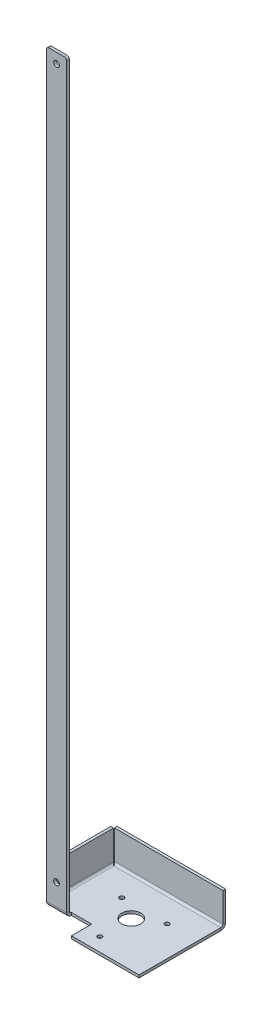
ISO-10303-21;
HEADER;
FILE_DESCRIPTION(('STEP AP214'),'2;1');
FILE_NAME('part.step','',(''),(''),'','','');
FILE_SCHEMA(('AUTOMOTIVE_DESIGN { 1 0 10303 214 1 1 1 1 }'));
ENDSEC;
DATA;
#1=APPLICATION_CONTEXT('core data for automotive mechanical design processes');
#2=APPLICATION_PROTOCOL_DEFINITION('international standard','automotive_design',2000,#1);
#3=PRODUCT_CONTEXT('',#1,'mechanical');
#4=PRODUCT('Part','Part','',(#3));
#5=PRODUCT_RELATED_PRODUCT_CATEGORY('part','',(#4));
#6=PRODUCT_DEFINITION_FORMATION('','',#4);
#7=PRODUCT_DEFINITION_CONTEXT('part definition',#1,'design');
#8=PRODUCT_DEFINITION('design','',#6,#7);
#9=PRODUCT_DEFINITION_SHAPE('','',#8);
#10=(LENGTH_UNIT() NAMED_UNIT(*) SI_UNIT(.MILLI.,.METRE.));
#11=(NAMED_UNIT(*) PLANE_ANGLE_UNIT() SI_UNIT($,.RADIAN.));
#12=(NAMED_UNIT(*) SI_UNIT($,.STERADIAN.) SOLID_ANGLE_UNIT());
#13=UNCERTAINTY_MEASURE_WITH_UNIT(LENGTH_MEASURE(1.E-05),#10,'distance_accuracy_value','');
#14=(GEOMETRIC_REPRESENTATION_CONTEXT(3) GLOBAL_UNCERTAINTY_ASSIGNED_CONTEXT((#13)) GLOBAL_UNIT_ASSIGNED_CONTEXT((#10,
#11,#12)) REPRESENTATION_CONTEXT('',''));
#15=CARTESIAN_POINT('',(0.,0.,0.));
#16=DIRECTION('',(0.,0.,1.));
#17=DIRECTION('',(1.,0.,0.));
#18=AXIS2_PLACEMENT_3D('',#15,#16,#17);
#19=CARTESIAN_POINT('',(0.,-1.00000000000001,-6.99999999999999));
#20=DIRECTION('',(0.,0.,-1.));
#21=DIRECTION('',(0.,1.,0.));
#22=AXIS2_PLACEMENT_3D('',#19,#20,#21);
#23=PLANE('',#22);
#24=DIRECTION('',(0.,-1.,0.));
#25=VECTOR('',#24,1.);
#26=CARTESIAN_POINT('',(0.,-1.00000000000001,-6.99999999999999));
#27=LINE('',#26,#25);
#28=CARTESIAN_POINT('',(0.,-4.70820393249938,-6.99999999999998));
#29=VERTEX_POINT('',#28);
#30=CARTESIAN_POINT('',(0.,-5.00000000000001,-6.99999999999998));
#31=VERTEX_POINT('',#30);
#32=EDGE_CURVE('E112',#29,#31,#27,.T.);
#33=ORIENTED_EDGE('',*,*,#32,.F.);
#34=CARTESIAN_POINT('',(1.99999999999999,1.99999999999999,-7.));
#35=DIRECTION('',(0.,0.,1.));
#36=DIRECTION('',(0.,-1.,0.));
#37=AXIS2_PLACEMENT_3D('',#34,#35,#36);
#38=CIRCLE('',#37,7.);
#39=CARTESIAN_POINT('',(1.99999999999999,-5.00000000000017,-6.99999999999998));
#40=VERTEX_POINT('',#39);
#41=EDGE_CURVE('E13',#29,#40,#38,.T.);
#42=ORIENTED_EDGE('',*,*,#41,.T.);
#43=DIRECTION('',(1.,0.,0.));
#44=VECTOR('',#43,1.);
#45=CARTESIAN_POINT('',(0.,-5.00000000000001,-6.99999999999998));
#46=LINE('',#45,#44);
#47=EDGE_CURVE('E565',#31,#40,#46,.T.);
#48=ORIENTED_EDGE('',*,*,#47,.F.);
#49=EDGE_LOOP('',(#33,#42,#48));
#50=FACE_BOUND('',#49,.T.);
#51=ADVANCED_FACE('F96',(#50),#23,.T.);
#52=CARTESIAN_POINT('',(0.,-4.99999999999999,0.));
#53=DIRECTION('',(0.,-1.,0.));
#54=DIRECTION('',(0.,0.,-1.));
#55=AXIS2_PLACEMENT_3D('',#52,#53,#54);
#56=PLANE('',#55);
#57=CARTESIAN_POINT('',(115.5,-5.00000000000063,-63.));
#58=DIRECTION('',(0.,1.,0.));
#59=DIRECTION('',(0.,0.,1.));
#60=AXIS2_PLACEMENT_3D('',#57,#58,#59);
#61=CIRCLE('',#60,3.25000000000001);
#62=CARTESIAN_POINT('',(115.5,-5.00000000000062,-59.75));
#63=VERTEX_POINT('',#62);
#64=EDGE_CURVE('E564',#63,#63,#61,.T.);
#65=ORIENTED_EDGE('',*,*,#64,.T.);
#66=EDGE_LOOP('',(#65));
#67=FACE_BOUND('',#66,.T.);
#68=CARTESIAN_POINT('',(48.5,-5.00000000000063,-63.));
#69=DIRECTION('',(0.,1.,0.));
#70=DIRECTION('',(0.,0.,1.));
#71=AXIS2_PLACEMENT_3D('',#68,#69,#70);
#72=CIRCLE('',#71,3.25000000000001);
#73=CARTESIAN_POINT('',(48.5,-5.00000000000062,-59.75));
#74=VERTEX_POINT('',#73);
#75=EDGE_CURVE('E571',#74,#74,#72,.T.);
#76=ORIENTED_EDGE('',*,*,#75,.T.);
#77=EDGE_LOOP('',(#76));
#78=FACE_BOUND('',#77,.T.);
#79=CARTESIAN_POINT('',(82.,-5.0000000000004,3.00000000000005));
#80=DIRECTION('',(0.,1.,0.));
#81=DIRECTION('',(0.,0.,1.));
#82=AXIS2_PLACEMENT_3D('',#79,#80,#81);
#83=CIRCLE('',#82,3.25000000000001);
#84=CARTESIAN_POINT('',(82.,-5.00000000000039,6.25000000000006));
#85=VERTEX_POINT('',#84);
#86=EDGE_CURVE('E558',#85,#85,#83,.T.);
#87=ORIENTED_EDGE('',*,*,#86,.T.);
#88=EDGE_LOOP('',(#87));
#89=FACE_BOUND('',#88,.T.);
#90=CARTESIAN_POINT('',(82.,-5.00000000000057,-43.4999999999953));
#91=DIRECTION('',(0.,1.,0.));
#92=DIRECTION('',(0.,0.,1.));
#93=AXIS2_PLACEMENT_3D('',#90,#91,#92);
#94=CIRCLE('',#93,14.);
#95=CARTESIAN_POINT('',(82.,-5.00000000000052,-29.4999999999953));
#96=VERTEX_POINT('',#95);
#97=EDGE_CURVE('E546',#96,#96,#94,.T.);
#98=ORIENTED_EDGE('',*,*,#97,.T.);
#99=EDGE_LOOP('',(#98));
#100=FACE_BOUND('',#99,.T.);
#101=DIRECTION('',(0.,0.,1.));
#102=VECTOR('',#101,1.);
#103=CARTESIAN_POINT('',(1.99999999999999,-5.00000000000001,-6.99999999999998));
#104=LINE('',#103,#102);
#105=CARTESIAN_POINT('',(2.,-5.00000000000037,-98.));
#106=VERTEX_POINT('',#105);
#107=EDGE_CURVE('E669',#40,#106,#104,.F.);
#108=ORIENTED_EDGE('',*,*,#107,.T.);
#109=DIRECTION('',(-1.,0.,0.));
#110=VECTOR('',#109,1.);
#111=CARTESIAN_POINT('',(-0.292893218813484,-5.00000000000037,-98.));
#112=LINE('',#111,#110);
#113=CARTESIAN_POINT('',(160.,-5.00000000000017,-98.));
#114=VERTEX_POINT('',#113);
#115=EDGE_CURVE('E298',#106,#114,#112,.F.);
#116=ORIENTED_EDGE('',*,*,#115,.T.);
#117=DIRECTION('',(0.,0.,-1.));
#118=VECTOR('',#117,1.);
#119=CARTESIAN_POINT('',(160.,-5.00000000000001,-6.99999999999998));
#120=LINE('',#119,#118);
#121=CARTESIAN_POINT('',(160.,-5.00000000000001,23.));
#122=VERTEX_POINT('',#121);
#123=EDGE_CURVE('E532',#122,#114,#120,.T.);
#124=ORIENTED_EDGE('',*,*,#123,.F.);
#125=DIRECTION('',(1.,0.,0.));
#126=VECTOR('',#125,1.);
#127=CARTESIAN_POINT('',(160.,-5.00000000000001,23.));
#128=LINE('',#127,#126);
#129=CARTESIAN_POINT('',(60.,-5.00000000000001,23.));
#130=VERTEX_POINT('',#129);
#131=EDGE_CURVE('E542',#130,#122,#128,.T.);
#132=ORIENTED_EDGE('',*,*,#131,.F.);
#133=DIRECTION('',(0.,0.,-1.));
#134=VECTOR('',#133,1.);
#135=CARTESIAN_POINT('',(60.,-5.00000000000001,23.));
#136=LINE('',#135,#134);
#137=CARTESIAN_POINT('',(60.,-5.00000000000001,-6.99999999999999));
#138=VERTEX_POINT('',#137);
#139=EDGE_CURVE('E539',#130,#138,#136,.T.);
#140=ORIENTED_EDGE('',*,*,#139,.T.);
#141=DIRECTION('',(-1.,0.,0.));
#142=VECTOR('',#141,1.);
#143=CARTESIAN_POINT('',(160.,-5.00000000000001,-6.99999999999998));
#144=LINE('',#143,#142);
#145=CARTESIAN_POINT('',(30.,-5.00000000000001,-6.99999999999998));
#146=VERTEX_POINT('',#145);
#147=EDGE_CURVE('E530',#138,#146,#144,.T.);
#148=ORIENTED_EDGE('',*,*,#147,.T.);
#149=DIRECTION('',(-1.,0.,0.));
#150=VECTOR('',#149,1.);
#151=CARTESIAN_POINT('',(0.,-5.00000000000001,-6.99999999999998));
#152=LINE('',#151,#150);
#153=EDGE_CURVE('E506',#146,#40,#152,.T.);
#154=ORIENTED_EDGE('',*,*,#153,.T.);
#155=EDGE_LOOP('',(#108,#116,#124,#132,#140,#148,#154));
#156=FACE_BOUND('',#155,.T.);
#157=ADVANCED_FACE('F352',(#67,#78,#89,#100,#156),#56,.T.);
#158=CARTESIAN_POINT('',(0.,-0.999999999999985,0.));
#159=DIRECTION('',(0.,-1.,0.));
#160=DIRECTION('',(0.,0.,-1.));
#161=AXIS2_PLACEMENT_3D('',#158,#159,#160);
#162=PLANE('',#161);
#163=CARTESIAN_POINT('',(115.5,-1.00000000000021,-63.));
#164=DIRECTION('',(0.,1.,0.));
#165=DIRECTION('',(0.,0.,1.));
#166=AXIS2_PLACEMENT_3D('',#163,#164,#165);
#167=CIRCLE('',#166,3.25000000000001);
#168=CARTESIAN_POINT('',(115.5,-1.00000000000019,-59.75));
#169=VERTEX_POINT('',#168);
#170=EDGE_CURVE('E561',#169,#169,#167,.T.);
#171=ORIENTED_EDGE('',*,*,#170,.F.);
#172=EDGE_LOOP('',(#171));
#173=FACE_BOUND('',#172,.T.);
#174=CARTESIAN_POINT('',(48.5,-1.00000000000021,-63.));
#175=DIRECTION('',(0.,1.,0.));
#176=DIRECTION('',(0.,0.,1.));
#177=AXIS2_PLACEMENT_3D('',#174,#175,#176);
#178=CIRCLE('',#177,3.25000000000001);
#179=CARTESIAN_POINT('',(48.5,-1.00000000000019,-59.75));
#180=VERTEX_POINT('',#179);
#181=EDGE_CURVE('E568',#180,#180,#178,.T.);
#182=ORIENTED_EDGE('',*,*,#181,.F.);
#183=EDGE_LOOP('',(#182));
#184=FACE_BOUND('',#183,.T.);
#185=CARTESIAN_POINT('',(82.,-0.999999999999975,3.00000000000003));
#186=DIRECTION('',(0.,1.,0.));
#187=DIRECTION('',(0.,0.,1.));
#188=AXIS2_PLACEMENT_3D('',#185,#186,#187);
#189=CIRCLE('',#188,3.25000000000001);
#190=CARTESIAN_POINT('',(82.,-0.999999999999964,6.25000000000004));
#191=VERTEX_POINT('',#190);
#192=EDGE_CURVE('E574',#191,#191,#189,.T.);
#193=ORIENTED_EDGE('',*,*,#192,.F.);
#194=EDGE_LOOP('',(#193));
#195=FACE_BOUND('',#194,.T.);
#196=CARTESIAN_POINT('',(82.,-1.00000000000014,-43.4999999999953));
#197=DIRECTION('',(0.,1.,0.));
#198=DIRECTION('',(0.,0.,1.));
#199=AXIS2_PLACEMENT_3D('',#196,#197,#198);
#200=CIRCLE('',#199,14.);
#201=CARTESIAN_POINT('',(82.,-1.00000000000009,-29.4999999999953));
#202=VERTEX_POINT('',#201);
#203=EDGE_CURVE('E555',#202,#202,#200,.T.);
#204=ORIENTED_EDGE('',*,*,#203,.F.);
#205=EDGE_LOOP('',(#204));
#206=FACE_BOUND('',#205,.T.);
#207=DIRECTION('',(-1.,0.,0.));
#208=VECTOR('',#207,1.);
#209=CARTESIAN_POINT('',(-0.292893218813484,-1.00000000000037,-98.));
#210=LINE('',#209,#208);
#211=CARTESIAN_POINT('',(2.,-1.00000000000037,-98.));
#212=VERTEX_POINT('',#211);
#213=CARTESIAN_POINT('',(160.,-1.00000000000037,-98.));
#214=VERTEX_POINT('',#213);
#215=EDGE_CURVE('E303',#212,#214,#210,.F.);
#216=ORIENTED_EDGE('',*,*,#215,.F.);
#217=DIRECTION('',(0.,0.,1.));
#218=VECTOR('',#217,1.);
#219=CARTESIAN_POINT('',(1.99999999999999,-1.00000000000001,-6.99999999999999));
#220=LINE('',#219,#218);
#221=CARTESIAN_POINT('',(1.99999999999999,-1.00000000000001,-6.99999999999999));
#222=VERTEX_POINT('',#221);
#223=EDGE_CURVE('E593',#222,#212,#220,.F.);
#224=ORIENTED_EDGE('',*,*,#223,.F.);
#225=DIRECTION('',(1.,0.,0.));
#226=VECTOR('',#225,1.);
#227=CARTESIAN_POINT('',(30.,-1.00000000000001,-6.99999999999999));
#228=LINE('',#227,#226);
#229=CARTESIAN_POINT('',(30.,-1.00000000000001,-6.99999999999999));
#230=VERTEX_POINT('',#229);
#231=EDGE_CURVE('E522',#230,#222,#228,.F.);
#232=ORIENTED_EDGE('',*,*,#231,.F.);
#233=DIRECTION('',(-1.,0.,0.));
#234=VECTOR('',#233,1.);
#235=CARTESIAN_POINT('',(160.,-1.00000000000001,-6.99999999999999));
#236=LINE('',#235,#234);
#237=CARTESIAN_POINT('',(60.,-1.00000000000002,-6.99999999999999));
#238=VERTEX_POINT('',#237);
#239=EDGE_CURVE('E523',#238,#230,#236,.T.);
#240=ORIENTED_EDGE('',*,*,#239,.F.);
#241=DIRECTION('',(0.,0.,-1.));
#242=VECTOR('',#241,1.);
#243=CARTESIAN_POINT('',(60.,-1.00000000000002,23.));
#244=LINE('',#243,#242);
#245=CARTESIAN_POINT('',(60.,-1.00000000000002,23.));
#246=VERTEX_POINT('',#245);
#247=EDGE_CURVE('E537',#246,#238,#244,.T.);
#248=ORIENTED_EDGE('',*,*,#247,.F.);
#249=DIRECTION('',(-1.,0.,0.));
#250=VECTOR('',#249,1.);
#251=CARTESIAN_POINT('',(160.,-1.00000000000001,23.));
#252=LINE('',#251,#250);
#253=CARTESIAN_POINT('',(160.,-1.00000000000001,23.));
#254=VERTEX_POINT('',#253);
#255=EDGE_CURVE('E551',#254,#246,#252,.T.);
#256=ORIENTED_EDGE('',*,*,#255,.F.);
#257=DIRECTION('',(0.,0.,1.));
#258=VECTOR('',#257,1.);
#259=CARTESIAN_POINT('',(160.,-1.00000000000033,-100.));
#260=LINE('',#259,#258);
#261=EDGE_CURVE('E535',#214,#254,#260,.T.);
#262=ORIENTED_EDGE('',*,*,#261,.F.);
#263=EDGE_LOOP('',(#216,#224,#232,#240,#248,#256,#262));
#264=FACE_BOUND('',#263,.T.);
#265=ADVANCED_FACE('F357',(#173,#184,#195,#206,#264),#162,.F.);
#266=CARTESIAN_POINT('',(160.,-1.00000000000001,-6.99999999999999));
#267=DIRECTION('',(0.,0.,-1.));
#268=DIRECTION('',(0.,1.,0.));
#269=AXIS2_PLACEMENT_3D('',#266,#267,#268);
#270=PLANE('',#269);
#271=DIRECTION('',(0.,-1.,0.));
#272=VECTOR('',#271,1.);
#273=CARTESIAN_POINT('',(60.,-1.00000000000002,-6.99999999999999));
#274=LINE('',#273,#272);
#275=EDGE_CURVE('E543',#238,#138,#274,.T.);
#276=ORIENTED_EDGE('',*,*,#275,.F.);
#277=ORIENTED_EDGE('',*,*,#239,.T.);
#278=DIRECTION('',(0.,-1.,0.));
#279=VECTOR('',#278,1.);
#280=CARTESIAN_POINT('',(30.,-5.00000000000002,-6.99999999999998));
#281=LINE('',#280,#279);
#282=EDGE_CURVE('E519',#230,#146,#281,.T.);
#283=ORIENTED_EDGE('',*,*,#282,.T.);
#284=ORIENTED_EDGE('',*,*,#147,.F.);
#285=EDGE_LOOP('',(#276,#277,#283,#284));
#286=FACE_BOUND('',#285,.T.);
#287=ADVANCED_FACE('F394',(#286),#270,.F.);
#288=CARTESIAN_POINT('',(0.,0.,-4.));
#289=DIRECTION('',(-1.,0.,0.));
#290=DIRECTION('',(0.,0.,1.));
#291=AXIS2_PLACEMENT_3D('',#288,#289,#290);
#292=PLANE('',#291);
#293=DIRECTION('',(0.,-1.,0.));
#294=VECTOR('',#293,1.);
#295=CARTESIAN_POINT('',(0.,0.,0.));
#296=LINE('',#295,#294);
#297=CARTESIAN_POINT('',(0.,1092.56,0.));
#298=VERTEX_POINT('',#297);
#299=CARTESIAN_POINT('',(0.,1.99999999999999,0.));
#300=VERTEX_POINT('',#299);
#301=EDGE_CURVE('E477',#298,#300,#296,.T.);
#302=ORIENTED_EDGE('',*,*,#301,.F.);
#303=DIRECTION('',(0.,0.,1.));
#304=VECTOR('',#303,1.);
#305=CARTESIAN_POINT('',(0.,1092.56,-4.));
#306=LINE('',#305,#304);
#307=CARTESIAN_POINT('',(0.,1092.56,-4.));
#308=VERTEX_POINT('',#307);
#309=EDGE_CURVE('E453',#298,#308,#306,.F.);
#310=ORIENTED_EDGE('',*,*,#309,.T.);
#311=DIRECTION('',(0.,-1.,0.));
#312=VECTOR('',#311,1.);
#313=CARTESIAN_POINT('',(0.,0.,-4.));
#314=LINE('',#313,#312);
#315=CARTESIAN_POINT('',(0.,1.99999999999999,-4.));
#316=VERTEX_POINT('',#315);
#317=EDGE_CURVE('E473',#308,#316,#314,.T.);
#318=ORIENTED_EDGE('',*,*,#317,.T.);
#319=DIRECTION('',(0.,0.,1.));
#320=VECTOR('',#319,1.);
#321=CARTESIAN_POINT('',(0.,1.99999999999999,-4.));
#322=LINE('',#321,#320);
#323=EDGE_CURVE('E496',#316,#300,#322,.T.);
#324=ORIENTED_EDGE('',*,*,#323,.T.);
#325=EDGE_LOOP('',(#302,#310,#318,#324));
#326=FACE_BOUND('',#325,.T.);
#327=ADVANCED_FACE('F396',(#326),#292,.T.);
#328=CARTESIAN_POINT('',(0.,0.,-4.));
#329=DIRECTION('',(0.,0.,-1.));
#330=DIRECTION('',(-1.,0.,0.));
#331=AXIS2_PLACEMENT_3D('',#328,#329,#330);
#332=PLANE('',#331);
#333=CARTESIAN_POINT('',(15.,1081.56,-4.));
#334=DIRECTION('',(0.,0.,-1.));
#335=DIRECTION('',(-1.,0.,0.));
#336=AXIS2_PLACEMENT_3D('',#333,#334,#335);
#337=CIRCLE('',#336,4.24999999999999);
#338=CARTESIAN_POINT('',(10.75,1081.56,-4.));
#339=VERTEX_POINT('',#338);
#340=EDGE_CURVE('E489',#339,#339,#337,.T.);
#341=ORIENTED_EDGE('',*,*,#340,.F.);
#342=EDGE_LOOP('',(#341));
#343=FACE_BOUND('',#342,.T.);
#344=CARTESIAN_POINT('',(15.,33.56,-4.));
#345=DIRECTION('',(0.,0.,-1.));
#346=DIRECTION('',(-1.,0.,0.));
#347=AXIS2_PLACEMENT_3D('',#344,#345,#346);
#348=CIRCLE('',#347,4.24999999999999);
#349=CARTESIAN_POINT('',(10.75,33.56,-4.));
#350=VERTEX_POINT('',#349);
#351=EDGE_CURVE('E479',#350,#350,#348,.T.);
#352=ORIENTED_EDGE('',*,*,#351,.F.);
#353=EDGE_LOOP('',(#352));
#354=FACE_BOUND('',#353,.T.);
#355=ORIENTED_EDGE('',*,*,#317,.F.);
#356=CARTESIAN_POINT('',(4.,1092.56,-4.));
#357=DIRECTION('',(0.,0.,-1.));
#358=DIRECTION('',(-1.,0.,0.));
#359=AXIS2_PLACEMENT_3D('',#356,#357,#358);
#360=CIRCLE('',#359,4.);
#361=CARTESIAN_POINT('',(4.,1096.56,-4.));
#362=VERTEX_POINT('',#361);
#363=EDGE_CURVE('E452',#308,#362,#360,.T.);
#364=ORIENTED_EDGE('',*,*,#363,.T.);
#365=DIRECTION('',(-1.,0.,0.));
#366=VECTOR('',#365,1.);
#367=CARTESIAN_POINT('',(0.,1096.56,-4.));
#368=LINE('',#367,#366);
#369=CARTESIAN_POINT('',(26.,1096.56,-4.));
#370=VERTEX_POINT('',#369);
#371=EDGE_CURVE('E469',#370,#362,#368,.T.);
#372=ORIENTED_EDGE('',*,*,#371,.F.);
#373=CARTESIAN_POINT('',(26.,1092.56,-4.));
#374=DIRECTION('',(0.,0.,-1.));
#375=DIRECTION('',(-1.,0.,0.));
#376=AXIS2_PLACEMENT_3D('',#373,#374,#375);
#377=CIRCLE('',#376,4.);
#378=CARTESIAN_POINT('',(30.,1092.56,-4.));
#379=VERTEX_POINT('',#378);
#380=EDGE_CURVE('E120',#370,#379,#377,.T.);
#381=ORIENTED_EDGE('',*,*,#380,.T.);
#382=DIRECTION('',(0.,1.,0.));
#383=VECTOR('',#382,1.);
#384=CARTESIAN_POINT('',(30.,0.,-4.));
#385=LINE('',#384,#383);
#386=CARTESIAN_POINT('',(30.,1.99999999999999,-4.));
#387=VERTEX_POINT('',#386);
#388=EDGE_CURVE('E481',#387,#379,#385,.T.);
#389=ORIENTED_EDGE('',*,*,#388,.F.);
#390=DIRECTION('',(-1.,0.,0.));
#391=VECTOR('',#390,1.);
#392=CARTESIAN_POINT('',(0.,1.99999999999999,-4.));
#393=LINE('',#392,#391);
#394=EDGE_CURVE('E505',#316,#387,#393,.F.);
#395=ORIENTED_EDGE('',*,*,#394,.F.);
#396=EDGE_LOOP('',(#355,#364,#372,#381,#389,#395));
#397=FACE_BOUND('',#396,.T.);
#398=ADVANCED_FACE('F426',(#343,#354,#397),#332,.T.);
#399=CARTESIAN_POINT('',(0.,0.,0.));
#400=DIRECTION('',(0.,0.,-1.));
#401=DIRECTION('',(-1.,0.,0.));
#402=AXIS2_PLACEMENT_3D('',#399,#400,#401);
#403=PLANE('',#402);
#404=CARTESIAN_POINT('',(15.,33.56,0.));
#405=DIRECTION('',(0.,0.,1.));
#406=DIRECTION('',(1.,0.,0.));
#407=AXIS2_PLACEMENT_3D('',#404,#405,#406);
#408=CIRCLE('',#407,4.24999999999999);
#409=CARTESIAN_POINT('',(19.25,33.56,0.));
#410=VERTEX_POINT('',#409);
#411=EDGE_CURVE('E486',#410,#410,#408,.T.);
#412=ORIENTED_EDGE('',*,*,#411,.F.);
#413=EDGE_LOOP('',(#412));
#414=FACE_BOUND('',#413,.T.);
#415=CARTESIAN_POINT('',(15.,1081.56,0.));
#416=DIRECTION('',(0.,0.,1.));
#417=DIRECTION('',(1.,0.,0.));
#418=AXIS2_PLACEMENT_3D('',#415,#416,#417);
#419=CIRCLE('',#418,4.24999999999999);
#420=CARTESIAN_POINT('',(19.25,1081.56,0.));
#421=VERTEX_POINT('',#420);
#422=EDGE_CURVE('E492',#421,#421,#419,.T.);
#423=ORIENTED_EDGE('',*,*,#422,.F.);
#424=EDGE_LOOP('',(#423));
#425=FACE_BOUND('',#424,.T.);
#426=DIRECTION('',(-1.,0.,0.));
#427=VECTOR('',#426,1.);
#428=CARTESIAN_POINT('',(0.,1096.56,0.));
#429=LINE('',#428,#427);
#430=CARTESIAN_POINT('',(26.,1096.56,0.));
#431=VERTEX_POINT('',#430);
#432=CARTESIAN_POINT('',(4.,1096.56,0.));
#433=VERTEX_POINT('',#432);
#434=EDGE_CURVE('E470',#431,#433,#429,.T.);
#435=ORIENTED_EDGE('',*,*,#434,.T.);
#436=CARTESIAN_POINT('',(4.,1092.56,0.));
#437=DIRECTION('',(0.,0.,-1.));
#438=DIRECTION('',(-1.,0.,0.));
#439=AXIS2_PLACEMENT_3D('',#436,#437,#438);
#440=CIRCLE('',#439,4.);
#441=EDGE_CURVE('E462',#433,#298,#440,.F.);
#442=ORIENTED_EDGE('',*,*,#441,.T.);
#443=ORIENTED_EDGE('',*,*,#301,.T.);
#444=DIRECTION('',(-1.,0.,0.));
#445=VECTOR('',#444,1.);
#446=CARTESIAN_POINT('',(0.,1.99999999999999,0.));
#447=LINE('',#446,#445);
#448=CARTESIAN_POINT('',(30.,1.99999999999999,0.));
#449=VERTEX_POINT('',#448);
#450=EDGE_CURVE('E515',#300,#449,#447,.F.);
#451=ORIENTED_EDGE('',*,*,#450,.T.);
#452=DIRECTION('',(0.,1.,0.));
#453=VECTOR('',#452,1.);
#454=CARTESIAN_POINT('',(30.,0.,0.));
#455=LINE('',#454,#453);
#456=CARTESIAN_POINT('',(30.,1092.56,0.));
#457=VERTEX_POINT('',#456);
#458=EDGE_CURVE('E474',#449,#457,#455,.T.);
#459=ORIENTED_EDGE('',*,*,#458,.T.);
#460=CARTESIAN_POINT('',(26.,1092.56,0.));
#461=DIRECTION('',(0.,0.,-1.));
#462=DIRECTION('',(-1.,0.,0.));
#463=AXIS2_PLACEMENT_3D('',#460,#461,#462);
#464=CIRCLE('',#463,4.);
#465=EDGE_CURVE('E464',#457,#431,#464,.F.);
#466=ORIENTED_EDGE('',*,*,#465,.T.);
#467=EDGE_LOOP('',(#435,#442,#443,#451,#459,#466));
#468=FACE_BOUND('',#467,.T.);
#469=ADVANCED_FACE('F429',(#414,#425,#468),#403,.F.);
#470=CARTESIAN_POINT('',(0.,1096.56,-4.));
#471=DIRECTION('',(0.,1.,0.));
#472=DIRECTION('',(0.,0.,1.));
#473=AXIS2_PLACEMENT_3D('',#470,#471,#472);
#474=PLANE('',#473);
#475=ORIENTED_EDGE('',*,*,#371,.T.);
#476=DIRECTION('',(0.,0.,1.));
#477=VECTOR('',#476,1.);
#478=CARTESIAN_POINT('',(4.,1096.56,-4.));
#479=LINE('',#478,#477);
#480=EDGE_CURVE('E455',#362,#433,#479,.T.);
#481=ORIENTED_EDGE('',*,*,#480,.T.);
#482=ORIENTED_EDGE('',*,*,#434,.F.);
#483=DIRECTION('',(0.,0.,1.));
#484=VECTOR('',#483,1.);
#485=CARTESIAN_POINT('',(26.,1096.56,-4.));
#486=LINE('',#485,#484);
#487=EDGE_CURVE('E467',#431,#370,#486,.F.);
#488=ORIENTED_EDGE('',*,*,#487,.T.);
#489=EDGE_LOOP('',(#475,#481,#482,#488));
#490=FACE_BOUND('',#489,.T.);
#491=ADVANCED_FACE('F433',(#490),#474,.T.);
#492=CARTESIAN_POINT('',(30.,0.,-4.));
#493=DIRECTION('',(1.,0.,0.));
#494=DIRECTION('',(0.,0.,-1.));
#495=AXIS2_PLACEMENT_3D('',#492,#493,#494);
#496=PLANE('',#495);
#497=ORIENTED_EDGE('',*,*,#388,.T.);
#498=DIRECTION('',(0.,0.,1.));
#499=VECTOR('',#498,1.);
#500=CARTESIAN_POINT('',(30.,1092.56,-4.));
#501=LINE('',#500,#499);
#502=EDGE_CURVE('E100',#379,#457,#501,.T.);
#503=ORIENTED_EDGE('',*,*,#502,.T.);
#504=ORIENTED_EDGE('',*,*,#458,.F.);
#505=DIRECTION('',(0.,0.,1.));
#506=VECTOR('',#505,1.);
#507=CARTESIAN_POINT('',(30.,1.99999999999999,-4.));
#508=LINE('',#507,#506);
#509=EDGE_CURVE('E495',#387,#449,#508,.T.);
#510=ORIENTED_EDGE('',*,*,#509,.F.);
#511=EDGE_LOOP('',(#497,#503,#504,#510));
#512=FACE_BOUND('',#511,.T.);
#513=ADVANCED_FACE('F424',(#512),#496,.T.);
#514=CARTESIAN_POINT('',(15.,33.56,0.));
#515=DIRECTION('',(0.,0.,1.));
#516=DIRECTION('',(1.,0.,0.));
#517=AXIS2_PLACEMENT_3D('',#514,#515,#516);
#518=CYLINDRICAL_SURFACE('',#517,4.24999999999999);
#519=ORIENTED_EDGE('',*,*,#351,.T.);
#520=EDGE_LOOP('',(#519));
#521=FACE_BOUND('',#520,.T.);
#522=ORIENTED_EDGE('',*,*,#411,.T.);
#523=EDGE_LOOP('',(#522));
#524=FACE_BOUND('',#523,.T.);
#525=ADVANCED_FACE('F420',(#521,#524),#518,.F.);
#526=CARTESIAN_POINT('',(15.,1081.56,0.));
#527=DIRECTION('',(0.,0.,1.));
#528=DIRECTION('',(1.,0.,0.));
#529=AXIS2_PLACEMENT_3D('',#526,#527,#528);
#530=CYLINDRICAL_SURFACE('',#529,4.24999999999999);
#531=ORIENTED_EDGE('',*,*,#340,.T.);
#532=EDGE_LOOP('',(#531));
#533=FACE_BOUND('',#532,.T.);
#534=ORIENTED_EDGE('',*,*,#422,.T.);
#535=EDGE_LOOP('',(#534));
#536=FACE_BOUND('',#535,.T.);
#537=ADVANCED_FACE('F413',(#533,#536),#530,.F.);
#538=CARTESIAN_POINT('',(30.,1.99999999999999,-7.));
#539=DIRECTION('',(1.,0.,0.));
#540=DIRECTION('',(0.,0.,-1.));
#541=AXIS2_PLACEMENT_3D('',#538,#539,#540);
#542=PLANE('',#541);
#543=ORIENTED_EDGE('',*,*,#282,.F.);
#544=CARTESIAN_POINT('',(30.,1.99999999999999,-7.));
#545=DIRECTION('',(-1.,0.,0.));
#546=DIRECTION('',(0.,0.,1.));
#547=AXIS2_PLACEMENT_3D('',#544,#545,#546);
#548=CIRCLE('',#547,3.);
#549=EDGE_CURVE('E509',#387,#230,#548,.F.);
#550=ORIENTED_EDGE('',*,*,#549,.F.);
#551=ORIENTED_EDGE('',*,*,#509,.T.);
#552=CARTESIAN_POINT('',(30.,1.99999999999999,-7.));
#553=DIRECTION('',(-1.,0.,0.));
#554=DIRECTION('',(0.,0.,1.));
#555=AXIS2_PLACEMENT_3D('',#552,#553,#554);
#556=CIRCLE('',#555,7.);
#557=EDGE_CURVE('E499',#449,#146,#556,.F.);
#558=ORIENTED_EDGE('',*,*,#557,.T.);
#559=EDGE_LOOP('',(#543,#550,#551,#558));
#560=FACE_BOUND('',#559,.T.);
#561=ADVANCED_FACE('F410',(#560),#542,.T.);
#562=CARTESIAN_POINT('',(0.,1.99999999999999,-7.));
#563=DIRECTION('',(1.,0.,0.));
#564=DIRECTION('',(0.,0.,-1.));
#565=AXIS2_PLACEMENT_3D('',#562,#563,#564);
#566=PLANE('',#565);
#567=CARTESIAN_POINT('',(0.,1.99999999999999,-7.));
#568=DIRECTION('',(-1.,0.,0.));
#569=DIRECTION('',(0.,0.,1.));
#570=AXIS2_PLACEMENT_3D('',#567,#568,#569);
#571=CIRCLE('',#570,3.);
#572=CARTESIAN_POINT('',(0.,-1.00000000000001,-6.99999999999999));
#573=VERTEX_POINT('',#572);
#574=EDGE_CURVE('E502',#573,#316,#571,.T.);
#575=ORIENTED_EDGE('',*,*,#574,.F.);
#576=EDGE_CURVE('E525',#573,#29,#27,.T.);
#577=ORIENTED_EDGE('',*,*,#576,.T.);
#578=ORIENTED_EDGE('',*,*,#32,.T.);
#579=CARTESIAN_POINT('',(0.,1.99999999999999,-7.));
#580=DIRECTION('',(-1.,0.,0.));
#581=DIRECTION('',(0.,0.,1.));
#582=AXIS2_PLACEMENT_3D('',#579,#580,#581);
#583=CIRCLE('',#582,7.);
#584=EDGE_CURVE('E512',#31,#300,#583,.T.);
#585=ORIENTED_EDGE('',*,*,#584,.T.);
#586=ORIENTED_EDGE('',*,*,#323,.F.);
#587=EDGE_LOOP('',(#575,#577,#578,#585,#586));
#588=FACE_BOUND('',#587,.T.);
#589=ADVANCED_FACE('F405',(#588),#566,.F.);
#590=CARTESIAN_POINT('',(0.,1.99999999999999,-7.));
#591=DIRECTION('',(-1.,0.,0.));
#592=DIRECTION('',(0.,-1.,0.));
#593=AXIS2_PLACEMENT_3D('',#590,#591,#592);
#594=CYLINDRICAL_SURFACE('',#593,7.);
#595=ORIENTED_EDGE('',*,*,#450,.F.);
#596=ORIENTED_EDGE('',*,*,#584,.F.);
#597=ORIENTED_EDGE('',*,*,#47,.T.);
#598=ORIENTED_EDGE('',*,*,#153,.F.);
#599=ORIENTED_EDGE('',*,*,#557,.F.);
#600=EDGE_LOOP('',(#595,#596,#597,#598,#599));
#601=FACE_BOUND('',#600,.T.);
#602=ADVANCED_FACE('F402',(#601),#594,.T.);
#603=CARTESIAN_POINT('',(0.,1.99999999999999,-7.));
#604=DIRECTION('',(-1.,0.,0.));
#605=DIRECTION('',(0.,-1.,0.));
#606=AXIS2_PLACEMENT_3D('',#603,#604,#605);
#607=CYLINDRICAL_SURFACE('',#606,3.);
#608=ORIENTED_EDGE('',*,*,#394,.T.);
#609=ORIENTED_EDGE('',*,*,#549,.T.);
#610=ORIENTED_EDGE('',*,*,#231,.T.);
#611=DIRECTION('',(1.,0.,0.));
#612=VECTOR('',#611,1.);
#613=CARTESIAN_POINT('',(0.,-1.00000000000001,-6.99999999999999));
#614=LINE('',#613,#612);
#615=EDGE_CURVE('E581',#573,#222,#614,.T.);
#616=ORIENTED_EDGE('',*,*,#615,.F.);
#617=ORIENTED_EDGE('',*,*,#574,.T.);
#618=EDGE_LOOP('',(#608,#609,#610,#616,#617));
#619=FACE_BOUND('',#618,.T.);
#620=ADVANCED_FACE('F392',(#619),#607,.F.);
#621=CARTESIAN_POINT('',(160.,0.,0.));
#622=DIRECTION('',(1.,0.,0.));
#623=DIRECTION('',(0.,0.,-1.));
#624=AXIS2_PLACEMENT_3D('',#621,#622,#623);
#625=PLANE('',#624);
#626=DIRECTION('',(0.,-1.,0.));
#627=VECTOR('',#626,1.);
#628=CARTESIAN_POINT('',(160.,-1.00000000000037,-98.));
#629=LINE('',#628,#627);
#630=EDGE_CURVE('E297',#214,#114,#629,.T.);
#631=ORIENTED_EDGE('',*,*,#630,.F.);
#632=ORIENTED_EDGE('',*,*,#261,.T.);
#633=DIRECTION('',(0.,1.,0.));
#634=VECTOR('',#633,1.);
#635=CARTESIAN_POINT('',(160.,-1.00000000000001,23.));
#636=LINE('',#635,#634);
#637=EDGE_CURVE('E545',#122,#254,#636,.T.);
#638=ORIENTED_EDGE('',*,*,#637,.F.);
#639=ORIENTED_EDGE('',*,*,#123,.T.);
#640=EDGE_LOOP('',(#631,#632,#638,#639));
#641=FACE_BOUND('',#640,.T.);
#642=ADVANCED_FACE('F388',(#641),#625,.T.);
#643=CARTESIAN_POINT('',(60.,-1.00000000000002,23.));
#644=DIRECTION('',(1.,0.,0.));
#645=DIRECTION('',(0.,0.,-1.));
#646=AXIS2_PLACEMENT_3D('',#643,#644,#645);
#647=PLANE('',#646);
#648=ORIENTED_EDGE('',*,*,#275,.T.);
#649=ORIENTED_EDGE('',*,*,#139,.F.);
#650=DIRECTION('',(0.,-1.,0.));
#651=VECTOR('',#650,1.);
#652=CARTESIAN_POINT('',(60.,-1.00000000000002,23.));
#653=LINE('',#652,#651);
#654=EDGE_CURVE('E549',#246,#130,#653,.T.);
#655=ORIENTED_EDGE('',*,*,#654,.F.);
#656=ORIENTED_EDGE('',*,*,#247,.T.);
#657=EDGE_LOOP('',(#648,#649,#655,#656));
#658=FACE_BOUND('',#657,.T.);
#659=ADVANCED_FACE('F384',(#658),#647,.F.);
#660=CARTESIAN_POINT('',(0.,0.,23.));
#661=DIRECTION('',(0.,0.,-1.));
#662=DIRECTION('',(-1.,0.,0.));
#663=AXIS2_PLACEMENT_3D('',#660,#661,#662);
#664=PLANE('',#663);
#665=ORIENTED_EDGE('',*,*,#637,.T.);
#666=ORIENTED_EDGE('',*,*,#255,.T.);
#667=ORIENTED_EDGE('',*,*,#654,.T.);
#668=ORIENTED_EDGE('',*,*,#131,.T.);
#669=EDGE_LOOP('',(#665,#666,#667,#668));
#670=FACE_BOUND('',#669,.T.);
#671=ADVANCED_FACE('F380',(#670),#664,.F.);
#672=CARTESIAN_POINT('',(82.,-5.00000000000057,-43.4999999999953));
#673=DIRECTION('',(0.,1.,0.));
#674=DIRECTION('',(0.,0.,1.));
#675=AXIS2_PLACEMENT_3D('',#672,#673,#674);
#676=CYLINDRICAL_SURFACE('',#675,14.);
#677=ORIENTED_EDGE('',*,*,#97,.F.);
#678=EDGE_LOOP('',(#677));
#679=FACE_BOUND('',#678,.T.);
#680=ORIENTED_EDGE('',*,*,#203,.T.);
#681=EDGE_LOOP('',(#680));
#682=FACE_BOUND('',#681,.T.);
#683=ADVANCED_FACE('F368',(#679,#682),#676,.F.);
#684=CARTESIAN_POINT('',(82.,-5.0000000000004,3.00000000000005));
#685=DIRECTION('',(0.,1.,0.));
#686=DIRECTION('',(0.,0.,1.));
#687=AXIS2_PLACEMENT_3D('',#684,#685,#686);
#688=CYLINDRICAL_SURFACE('',#687,3.25000000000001);
#689=ORIENTED_EDGE('',*,*,#86,.F.);
#690=EDGE_LOOP('',(#689));
#691=FACE_BOUND('',#690,.T.);
#692=ORIENTED_EDGE('',*,*,#192,.T.);
#693=EDGE_LOOP('',(#692));
#694=FACE_BOUND('',#693,.T.);
#695=ADVANCED_FACE('F364',(#691,#694),#688,.F.);
#696=CARTESIAN_POINT('',(48.5,-5.00000000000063,-63.));
#697=DIRECTION('',(0.,1.,0.));
#698=DIRECTION('',(0.,0.,1.));
#699=AXIS2_PLACEMENT_3D('',#696,#697,#698);
#700=CYLINDRICAL_SURFACE('',#699,3.25000000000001);
#701=ORIENTED_EDGE('',*,*,#75,.F.);
#702=EDGE_LOOP('',(#701));
#703=FACE_BOUND('',#702,.T.);
#704=ORIENTED_EDGE('',*,*,#181,.T.);
#705=EDGE_LOOP('',(#704));
#706=FACE_BOUND('',#705,.T.);
#707=ADVANCED_FACE('F367',(#703,#706),#700,.F.);
#708=CARTESIAN_POINT('',(115.5,-5.00000000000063,-63.));
#709=DIRECTION('',(0.,1.,0.));
#710=DIRECTION('',(0.,0.,1.));
#711=AXIS2_PLACEMENT_3D('',#708,#709,#710);
#712=CYLINDRICAL_SURFACE('',#711,3.25000000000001);
#713=ORIENTED_EDGE('',*,*,#64,.F.);
#714=EDGE_LOOP('',(#713));
#715=FACE_BOUND('',#714,.T.);
#716=ORIENTED_EDGE('',*,*,#170,.T.);
#717=EDGE_LOOP('',(#716));
#718=FACE_BOUND('',#717,.T.);
#719=ADVANCED_FACE('F372',(#715,#718),#712,.F.);
#720=CARTESIAN_POINT('',(4.,1092.56,-4.));
#721=DIRECTION('',(0.,0.,1.));
#722=DIRECTION('',(1.,0.,0.));
#723=AXIS2_PLACEMENT_3D('',#720,#721,#722);
#724=CYLINDRICAL_SURFACE('',#723,4.);
#725=ORIENTED_EDGE('',*,*,#363,.F.);
#726=ORIENTED_EDGE('',*,*,#309,.F.);
#727=ORIENTED_EDGE('',*,*,#441,.F.);
#728=ORIENTED_EDGE('',*,*,#480,.F.);
#729=EDGE_LOOP('',(#725,#726,#727,#728));
#730=FACE_BOUND('',#729,.T.);
#731=ADVANCED_FACE('F376',(#730),#724,.T.);
#732=CARTESIAN_POINT('',(26.,1092.56,-4.));
#733=DIRECTION('',(0.,0.,1.));
#734=DIRECTION('',(1.,0.,0.));
#735=AXIS2_PLACEMENT_3D('',#732,#733,#734);
#736=CYLINDRICAL_SURFACE('',#735,4.);
#737=ORIENTED_EDGE('',*,*,#380,.F.);
#738=ORIENTED_EDGE('',*,*,#487,.F.);
#739=ORIENTED_EDGE('',*,*,#465,.F.);
#740=ORIENTED_EDGE('',*,*,#502,.F.);
#741=EDGE_LOOP('',(#737,#738,#739,#740));
#742=FACE_BOUND('',#741,.T.);
#743=ADVANCED_FACE('F98',(#742),#736,.T.);
#744=CARTESIAN_POINT('',(1.99999999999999,1.99999999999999,-7.));
#745=DIRECTION('',(0.,0.,-1.));
#746=DIRECTION('',(0.,1.,0.));
#747=AXIS2_PLACEMENT_3D('',#744,#745,#746);
#748=PLANE('',#747);
#749=ORIENTED_EDGE('',*,*,#576,.F.);
#750=ORIENTED_EDGE('',*,*,#615,.T.);
#751=CARTESIAN_POINT('',(1.99999999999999,1.99999999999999,-7.));
#752=DIRECTION('',(0.,0.,1.));
#753=DIRECTION('',(0.,-1.,0.));
#754=AXIS2_PLACEMENT_3D('',#751,#752,#753);
#755=CIRCLE('',#754,3.);
#756=CARTESIAN_POINT('',(-1.00000000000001,1.99999999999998,-7.));
#757=VERTEX_POINT('',#756);
#758=EDGE_CURVE('E670',#757,#222,#755,.T.);
#759=ORIENTED_EDGE('',*,*,#758,.F.);
#760=DIRECTION('',(1.,0.,0.));
#761=VECTOR('',#760,1.);
#762=CARTESIAN_POINT('',(-1.00000000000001,1.99999999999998,-7.00000000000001));
#763=LINE('',#762,#761);
#764=CARTESIAN_POINT('',(-5.00000000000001,1.99999999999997,-7.));
#765=VERTEX_POINT('',#764);
#766=EDGE_CURVE('E641',#757,#765,#763,.F.);
#767=ORIENTED_EDGE('',*,*,#766,.T.);
#768=EDGE_CURVE('E106',#765,#29,#38,.T.);
#769=ORIENTED_EDGE('',*,*,#768,.T.);
#770=EDGE_LOOP('',(#749,#750,#759,#767,#769));
#771=FACE_BOUND('',#770,.T.);
#772=ADVANCED_FACE('F362',(#771),#748,.F.);
#773=CARTESIAN_POINT('',(1.99999999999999,-5.04000000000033,-98.));
#774=CARTESIAN_POINT('',(1.07830682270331,-5.04000000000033,-98.1911075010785));
#775=CARTESIAN_POINT('',(0.157294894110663,-4.85676764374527,-98.3821488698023));
#776=CARTESIAN_POINT('',(-1.54547762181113,-4.15145617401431,-98.7642977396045));
#777=CARTESIAN_POINT('',(-2.3264089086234,-3.62965457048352,-98.9553721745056));
#778=CARTESIAN_POINT('',(-3.62965457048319,-2.32640890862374,-99.3375210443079));
#779=CARTESIAN_POINT('',(-4.15145617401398,-1.54547762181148,-99.528595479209));
#780=CARTESIAN_POINT('',(-4.85676764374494,0.157294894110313,-99.9107443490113));
#781=CARTESIAN_POINT('',(-5.04000000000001,1.07830682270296,-100.101785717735));
#782=CARTESIAN_POINT('',(-5.04000000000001,1.99999999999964,-100.292893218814));
#783=CARTESIAN_POINT('',(1.99999999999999,-5.00000000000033,-98.));
#784=CARTESIAN_POINT('',(1.08354382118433,-5.00000000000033,-98.1911074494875));
#785=CARTESIAN_POINT('',(0.167764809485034,-4.81780873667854,-98.3821488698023));
#786=CARTESIAN_POINT('',(-1.5253328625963,-4.11650471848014,-98.7642977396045));
#787=CARTESIAN_POINT('',(-2.3018270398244,-3.5976678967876,-98.9553721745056));
#788=CARTESIAN_POINT('',(-3.59766789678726,-2.30182703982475,-99.3375210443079));
#789=CARTESIAN_POINT('',(-4.11650471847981,-1.52533286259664,-99.528595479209));
#790=CARTESIAN_POINT('',(-4.81780873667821,0.167764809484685,-99.9107443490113));
#791=CARTESIAN_POINT('',(-5.00000000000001,1.08354382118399,-100.101785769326));
#792=CARTESIAN_POINT('',(-5.00000000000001,1.99999999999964,-100.292893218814));
#793=CARTESIAN_POINT('',(1.99999999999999,-1.00000000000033,-98.));
#794=CARTESIAN_POINT('',(1.60724366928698,-1.00000000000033,-98.1911022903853));
#795=CARTESIAN_POINT('',(1.21475634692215,-0.921918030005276,-98.3821488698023));
#796=CARTESIAN_POINT('',(0.489143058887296,-0.621359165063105,-98.7642977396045));
#797=CARTESIAN_POINT('',(0.15635984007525,-0.399000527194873,-98.9553721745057));
#798=CARTESIAN_POINT('',(-0.399000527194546,0.156359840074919,-99.3375210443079));
#799=CARTESIAN_POINT('',(-0.621359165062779,0.489143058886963,-99.528595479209));
#800=CARTESIAN_POINT('',(-0.921918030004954,1.21475634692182,-99.9107443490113));
#801=CARTESIAN_POINT('',(-1.00000000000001,1.60724366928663,-100.101790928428));
#802=CARTESIAN_POINT('',(-1.00000000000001,1.99999999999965,-100.292893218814));
#803=CARTESIAN_POINT('',(1.99999999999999,-0.959600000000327,-98.));
#804=CARTESIAN_POINT('',(1.61253303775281,-0.959600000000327,-98.1911022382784));
#805=CARTESIAN_POINT('',(1.22533096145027,-0.882569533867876,-98.3821488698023));
#806=CARTESIAN_POINT('',(0.50948926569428,-0.586058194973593,-98.7642977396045));
#807=CARTESIAN_POINT('',(0.181187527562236,-0.366693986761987,-98.9553721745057));
#808=CARTESIAN_POINT('',(-0.366693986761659,0.181187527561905,-99.3375210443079));
#809=CARTESIAN_POINT('',(-0.586058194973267,0.509489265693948,-99.528595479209));
#810=CARTESIAN_POINT('',(-0.882569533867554,1.22533096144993,-99.9107443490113));
#811=CARTESIAN_POINT('',(-0.959600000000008,1.61253303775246,-100.101790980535));
#812=CARTESIAN_POINT('',(-0.95960000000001,1.99999999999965,-100.292893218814));
#813=B_SPLINE_SURFACE_WITH_KNOTS('',1,3,((#773,#774,#775,#776,#777,#778,#779,#780,#781,#782),
(#783,#784,#785,#786,#787,#788,#789,#790,#791,#792),(#793,#794,#795,#796,#797,#798,#799,#800,
#801,#802),(#803,#804,#805,#806,#807,#808,#809,#810,#811,#812)),.UNSPECIFIED.,.F.,.F.,.F.,(2,1,
1,2),(4,2,2,2,4),(-0.01,0.,1.,1.0101),(0.,0.25,0.5,0.75,1.),.UNSPECIFIED.);
#814=DIRECTION('',(1.,0.,0.));
#815=VECTOR('',#814,1.);
#816=CARTESIAN_POINT('',(-5.00000000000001,1.99999999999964,-100.292893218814));
#817=LINE('',#816,#815);
#818=CARTESIAN_POINT('',(-1.00000000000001,1.99999999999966,-100.292893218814));
#819=VERTEX_POINT('',#818);
#820=CARTESIAN_POINT('',(-5.00000000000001,1.99999999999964,-100.292893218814));
#821=VERTEX_POINT('',#820);
#822=EDGE_CURVE('E309',#819,#821,#817,.F.);
#823=CARTESIAN_POINT('',(1.99999999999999,-1.00000000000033,-98.));
#824=CARTESIAN_POINT('',(1.90605110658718,-1.00001394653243,-98.0457146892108));
#825=CARTESIAN_POINT('',(1.81210375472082,-0.995587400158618,-98.091427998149));
#826=CARTESIAN_POINT('',(1.62504108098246,-0.977953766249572,-98.1828499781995));
#827=CARTESIAN_POINT('',(1.5319257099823,-0.964747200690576,-98.228558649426));
#828=CARTESIAN_POINT('',(1.34742053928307,-0.929668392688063,-98.3199372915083));
#829=CARTESIAN_POINT('',(1.25602938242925,-0.907803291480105,-98.3656072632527));
#830=CARTESIAN_POINT('',(1.07570165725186,-0.85560530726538,-98.4569501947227));
#831=CARTESIAN_POINT('',(0.986765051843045,-0.825272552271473,-98.5026231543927));
#832=CARTESIAN_POINT('',(0.812088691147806,-0.75638984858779,-98.5939882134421));
#833=CARTESIAN_POINT('',(0.72635032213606,-0.71783638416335,-98.6396803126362));
#834=CARTESIAN_POINT('',(0.558834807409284,-0.632843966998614,-98.731079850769));
#835=CARTESIAN_POINT('',(0.47705913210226,-0.586402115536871,-98.7767872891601));
#836=CARTESIAN_POINT('',(0.318280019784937,-0.486087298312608,-98.8681676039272));
#837=CARTESIAN_POINT('',(0.241273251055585,-0.432219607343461,-98.9138404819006));
#838=CARTESIAN_POINT('',(0.0926237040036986,-0.317484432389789,-99.0052060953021));
#839=CARTESIAN_POINT('',(0.0209827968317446,-0.256614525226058,-99.0508988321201));
#840=CARTESIAN_POINT('',(-0.116226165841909,-0.128471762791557,-99.1422507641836));
#841=CARTESIAN_POINT('',(-0.181798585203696,-0.0612035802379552,-99.1879099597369));
#842=CARTESIAN_POINT('',(-0.306352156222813,0.0791811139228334,-99.2792278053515));
#843=CARTESIAN_POINT('',(-0.365333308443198,0.15229762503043,-99.324886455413));
#844=CARTESIAN_POINT('',(-0.476231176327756,0.303798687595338,-99.4162377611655));
#845=CARTESIAN_POINT('',(-0.528142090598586,0.382187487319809,-99.4619304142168));
#846=CARTESIAN_POINT('',(-0.624366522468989,0.543458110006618,-99.5533034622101));
#847=CARTESIAN_POINT('',(-0.668682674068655,0.626338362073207,-99.5989838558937));
#848=CARTESIAN_POINT('',(-0.749394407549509,0.795980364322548,-99.6903945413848));
#849=CARTESIAN_POINT('',(-0.78578130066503,0.882746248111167,-99.7361248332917));
#850=CARTESIAN_POINT('',(-0.850239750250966,1.05927738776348,-99.8275686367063));
#851=CARTESIAN_POINT('',(-0.878314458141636,1.14904149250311,-99.8732821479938));
#852=CARTESIAN_POINT('',(-0.925881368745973,1.33065892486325,-99.9646299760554));
#853=CARTESIAN_POINT('',(-0.94538728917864,1.42250866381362,-100.010264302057));
#854=CARTESIAN_POINT('',(-0.975701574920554,1.60759099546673,-100.101515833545));
#855=CARTESIAN_POINT('',(-0.986515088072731,1.70082273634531,-100.147133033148));
#856=CARTESIAN_POINT('',(-0.995295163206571,1.82857347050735,-100.209440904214));
#857=CARTESIAN_POINT('',(-0.997060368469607,1.86285735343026,-100.226142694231));
#858=CARTESIAN_POINT('',(-0.999411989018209,1.93142616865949,-100.259526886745));
#859=CARTESIAN_POINT('',(-0.999999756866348,1.96571105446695,-100.276209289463));
#860=CARTESIAN_POINT('',(-1.00000000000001,1.99999999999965,-100.292893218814));
#861=B_SPLINE_CURVE_WITH_KNOTS('',3,(#823,#824,#825,#826,#827,#828,#829,#830,#831,#832,#833,
#834,#835,#836,#837,#838,#839,#840,#841,#842,#843,#844,#845,#846,#847,#848,#849,#850,#851,#852,
#853,#854,#855,#856,#857,#858,#859,#860),.UNSPECIFIED.,.F.,.F.,(4,2,2,2,2,2,2,2,2,2,2,2,2,2,2,2,
2,2,4),(0.,0.313345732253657,0.626672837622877,0.939742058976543,1.25280654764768,
1.56600519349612,1.87931917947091,2.19241174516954,2.50561298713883,2.81858722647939,
3.13156143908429,3.44479093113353,3.75791156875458,4.07137361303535,4.38471666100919,
4.69755623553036,5.01021040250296,5.12472627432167,5.23911052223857),.UNSPECIFIED.);
#862=EDGE_CURVE('E585',#212,#819,#861,.T.);
#863=DIRECTION('',(0.,-1.,0.));
#864=VECTOR('',#863,1.);
#865=CARTESIAN_POINT('',(1.99999999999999,-1.00000000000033,-98.));
#866=LINE('',#865,#864);
#867=EDGE_CURVE('E584',#212,#106,#866,.T.);
#868=CARTESIAN_POINT('',(1.99999999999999,-5.00000000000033,-98.));
#869=CARTESIAN_POINT('',(1.83331707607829,-5.00001065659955,-98.0347591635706));
#870=CARTESIAN_POINT('',(1.6666363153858,-4.99404682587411,-98.0695183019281));
#871=CARTESIAN_POINT('',(1.33414875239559,-4.97024941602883,-98.1390304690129));
#872=CARTESIAN_POINT('',(1.16834182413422,-4.952417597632,-98.1737834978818));
#873=CARTESIAN_POINT('',(0.838328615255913,-4.90495001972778,-98.2433072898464));
#874=CARTESIAN_POINT('',(0.674123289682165,-4.87530761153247,-98.2780780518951));
#875=CARTESIAN_POINT('',(0.348233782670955,-4.80437230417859,-98.3476233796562));
#876=CARTESIAN_POINT('',(0.186549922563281,-4.76307793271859,-98.3823979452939));
#877=CARTESIAN_POINT('',(-0.166292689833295,-4.65939626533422,-98.4590866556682));
#878=CARTESIAN_POINT('',(-0.356696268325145,-4.59442000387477,-98.5010024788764));
#879=CARTESIAN_POINT('',(-0.731279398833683,-4.44829840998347,-98.5848495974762));
#880=CARTESIAN_POINT('',(-0.915456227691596,-4.36714610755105,-98.6267808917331));
#881=CARTESIAN_POINT('',(-1.27613102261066,-4.18929635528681,-98.7106403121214));
#882=CARTESIAN_POINT('',(-1.45262954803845,-4.09260004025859,-98.7525684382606));
#883=CARTESIAN_POINT('',(-1.79665374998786,-3.88437335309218,-98.8364222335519));
#884=CARTESIAN_POINT('',(-1.96417921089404,-3.77284262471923,-98.8783479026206));
#885=CARTESIAN_POINT('',(-2.2889966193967,-3.53578632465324,-98.9621991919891));
#886=CARTESIAN_POINT('',(-2.44628935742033,-3.41026183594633,-99.004124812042));
#887=CARTESIAN_POINT('',(-2.74948934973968,-3.14614162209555,-99.0879770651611));
#888=CARTESIAN_POINT('',(-2.89539654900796,-3.00754583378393,-99.1299036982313));
#889=CARTESIAN_POINT('',(-3.17475170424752,-2.71830190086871,-99.2137606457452));
#890=CARTESIAN_POINT('',(-3.30819880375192,-2.56765292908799,-99.2556909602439));
#891=CARTESIAN_POINT('',(-3.56163001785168,-2.25543164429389,-99.339547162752));
#892=CARTESIAN_POINT('',(-3.6816144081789,-2.09385955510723,-99.3814730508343));
#893=CARTESIAN_POINT('',(-3.90727241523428,-1.7609289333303,-99.4653392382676));
#894=CARTESIAN_POINT('',(-4.01294097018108,-1.58956696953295,-99.5072795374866));
#895=CARTESIAN_POINT('',(-4.20909697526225,-1.23844800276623,-99.591148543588));
#896=CARTESIAN_POINT('',(-4.29958981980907,-1.05869401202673,-99.6330772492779));
#897=CARTESIAN_POINT('',(-4.46476076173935,-0.692075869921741,-99.7169310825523));
#898=CARTESIAN_POINT('',(-4.53944070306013,-0.505212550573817,-99.7588562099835));
#899=CARTESIAN_POINT('',(-4.67242791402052,-0.125827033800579,-99.8426903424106));
#900=CARTESIAN_POINT('',(-4.73073830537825,0.0666940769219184,-99.8845993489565));
#901=CARTESIAN_POINT('',(-4.85341363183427,0.545212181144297,-99.9876090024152));
#902=CARTESIAN_POINT('',(-4.90835975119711,0.833706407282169,-100.048724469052));
#903=CARTESIAN_POINT('',(-4.96332324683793,1.26951494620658,-100.140321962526));
#904=CARTESIAN_POINT('',(-4.97706845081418,1.41524098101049,-100.170830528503));
#905=CARTESIAN_POINT('',(-4.99540657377,1.70729581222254,-100.23185401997));
#906=CARTESIAN_POINT('',(-4.99999773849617,1.85362471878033,-100.262368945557));
#907=CARTESIAN_POINT('',(-5.00000000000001,1.99999999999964,-100.292893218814));
#908=B_SPLINE_CURVE_WITH_KNOTS('',3,(#868,#869,#870,#871,#872,#873,#874,#875,#876,#877,#878,
#879,#880,#881,#882,#883,#884,#885,#886,#887,#888,#889,#890,#891,#892,#893,#894,#895,#896,#897,
#898,#899,#900,#901,#902,#903,#904,#905,#906,#907),.UNSPECIFIED.,.F.,.F.,(4,2,2,2,2,2,2,2,2,2,2,
2,2,2,2,2,2,2,2,4),(0.,0.510697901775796,1.02132005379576,1.53223006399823,2.04320465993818,
2.65896737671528,3.27499599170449,3.89097965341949,4.50697811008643,5.12292892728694,
5.73888272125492,6.3548788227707,6.97086230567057,7.58706302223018,8.20304423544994,
8.81895357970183,9.43474538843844,10.3320540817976,10.7803756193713,11.2287830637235),.UNSPECIFIED.);
#909=EDGE_CURVE('E594',#106,#821,#908,.T.);
#910=ORIENTED_EDGE('',*,*,#822,.F.);
#911=ORIENTED_EDGE('',*,*,#862,.F.);
#912=ORIENTED_EDGE('',*,*,#867,.T.);
#913=ORIENTED_EDGE('',*,*,#909,.T.);
#914=EDGE_LOOP('',(#910,#911,#912,#913));
#915=FACE_BOUND('',#914,.T.);
#916=ADVANCED_FACE('F601',(#915),#813,.F.);
#917=CARTESIAN_POINT('',(1.99999999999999,1.99999999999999,-7.));
#918=DIRECTION('',(0.,0.,1.));
#919=DIRECTION('',(-1.,0.,0.));
#920=AXIS2_PLACEMENT_3D('',#917,#918,#919);
#921=CYLINDRICAL_SURFACE('',#920,7.);
#922=ORIENTED_EDGE('',*,*,#107,.F.);
#923=ORIENTED_EDGE('',*,*,#41,.F.);
#924=ORIENTED_EDGE('',*,*,#768,.F.);
#925=DIRECTION('',(0.,0.,1.));
#926=VECTOR('',#925,1.);
#927=CARTESIAN_POINT('',(-5.00000000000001,1.99999999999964,-100.));
#928=LINE('',#927,#926);
#929=EDGE_CURVE('E632',#765,#821,#928,.F.);
#930=ORIENTED_EDGE('',*,*,#929,.T.);
#931=ORIENTED_EDGE('',*,*,#909,.F.);
#932=EDGE_LOOP('',(#922,#923,#924,#930,#931));
#933=FACE_BOUND('',#932,.T.);
#934=ADVANCED_FACE('F609',(#933),#921,.T.);
#935=CARTESIAN_POINT('',(1.99999999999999,1.99999999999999,-7.));
#936=DIRECTION('',(0.,0.,1.));
#937=DIRECTION('',(-1.,0.,0.));
#938=AXIS2_PLACEMENT_3D('',#935,#936,#937);
#939=CYLINDRICAL_SURFACE('',#938,3.);
#940=ORIENTED_EDGE('',*,*,#223,.T.);
#941=ORIENTED_EDGE('',*,*,#862,.T.);
#942=DIRECTION('',(0.,0.,1.));
#943=VECTOR('',#942,1.);
#944=CARTESIAN_POINT('',(-1.00000000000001,1.99999999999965,-100.));
#945=LINE('',#944,#943);
#946=EDGE_CURVE('E657',#819,#757,#945,.T.);
#947=ORIENTED_EDGE('',*,*,#946,.T.);
#948=ORIENTED_EDGE('',*,*,#758,.T.);
#949=EDGE_LOOP('',(#940,#941,#947,#948));
#950=FACE_BOUND('',#949,.T.);
#951=ADVANCED_FACE('F605',(#950),#939,.F.);
#952=CARTESIAN_POINT('',(-5.00000000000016,45.,-7.00000000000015));
#953=DIRECTION('',(0.,0.,-1.));
#954=DIRECTION('',(0.,1.,0.));
#955=AXIS2_PLACEMENT_3D('',#952,#953,#954);
#956=PLANE('',#955);
#957=ORIENTED_EDGE('',*,*,#766,.F.);
#958=DIRECTION('',(0.,-1.,0.));
#959=VECTOR('',#958,1.);
#960=CARTESIAN_POINT('',(-1.00000000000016,45.,-7.00000000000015));
#961=LINE('',#960,#959);
#962=CARTESIAN_POINT('',(-1.00000000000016,45.,-7.00000000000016));
#963=VERTEX_POINT('',#962);
#964=EDGE_CURVE('E640',#757,#963,#961,.F.);
#965=ORIENTED_EDGE('',*,*,#964,.T.);
#966=DIRECTION('',(1.,0.,0.));
#967=VECTOR('',#966,1.);
#968=CARTESIAN_POINT('',(-5.00000000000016,45.,-7.00000000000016));
#969=LINE('',#968,#967);
#970=CARTESIAN_POINT('',(-5.00000000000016,45.,-7.00000000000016));
#971=VERTEX_POINT('',#970);
#972=EDGE_CURVE('E647',#971,#963,#969,.T.);
#973=ORIENTED_EDGE('',*,*,#972,.F.);
#974=DIRECTION('',(0.,1.,0.));
#975=VECTOR('',#974,1.);
#976=CARTESIAN_POINT('',(-5.,0.,-6.99999999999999));
#977=LINE('',#976,#975);
#978=EDGE_CURVE('E634',#765,#971,#977,.T.);
#979=ORIENTED_EDGE('',*,*,#978,.F.);
#980=EDGE_LOOP('',(#957,#965,#973,#979));
#981=FACE_BOUND('',#980,.T.);
#982=ADVANCED_FACE('F608',(#981),#956,.F.);
#983=CARTESIAN_POINT('',(-5.,0.,0.));
#984=DIRECTION('',(1.,0.,0.));
#985=DIRECTION('',(0.,1.,0.));
#986=AXIS2_PLACEMENT_3D('',#983,#984,#985);
#987=PLANE('',#986);
#988=ORIENTED_EDGE('',*,*,#929,.F.);
#989=ORIENTED_EDGE('',*,*,#978,.T.);
#990=DIRECTION('',(0.,0.,-1.));
#991=VECTOR('',#990,1.);
#992=CARTESIAN_POINT('',(-5.00000000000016,45.,-1.54446348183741E-13));
#993=LINE('',#992,#991);
#994=CARTESIAN_POINT('',(-5.00000000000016,44.9999999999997,-100.292893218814));
#995=VERTEX_POINT('',#994);
#996=EDGE_CURVE('E649',#971,#995,#993,.T.);
#997=ORIENTED_EDGE('',*,*,#996,.T.);
#998=DIRECTION('',(0.,-1.,0.));
#999=VECTOR('',#998,1.);
#1000=CARTESIAN_POINT('',(-5.,-3.77055531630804E-13,-100.292893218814));
#1001=LINE('',#1000,#999);
#1002=EDGE_CURVE('E637',#995,#821,#1001,.T.);
#1003=ORIENTED_EDGE('',*,*,#1002,.T.);
#1004=EDGE_LOOP('',(#988,#989,#997,#1003));
#1005=FACE_BOUND('',#1004,.T.);
#1006=ADVANCED_FACE('F617',(#1005),#987,.F.);
#1007=CARTESIAN_POINT('',(-1.,0.,0.));
#1008=DIRECTION('',(1.,0.,0.));
#1009=DIRECTION('',(0.,1.,0.));
#1010=AXIS2_PLACEMENT_3D('',#1007,#1008,#1009);
#1011=PLANE('',#1010);
#1012=ORIENTED_EDGE('',*,*,#964,.F.);
#1013=ORIENTED_EDGE('',*,*,#946,.F.);
#1014=DIRECTION('',(0.,1.,0.));
#1015=VECTOR('',#1014,1.);
#1016=CARTESIAN_POINT('',(-0.999999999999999,-1.00000000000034,-100.292893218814));
#1017=LINE('',#1016,#1015);
#1018=CARTESIAN_POINT('',(-1.00000000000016,44.9999999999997,-100.292893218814));
#1019=VERTEX_POINT('',#1018);
#1020=EDGE_CURVE('E659',#1019,#819,#1017,.F.);
#1021=ORIENTED_EDGE('',*,*,#1020,.F.);
#1022=DIRECTION('',(0.,0.,1.));
#1023=VECTOR('',#1022,1.);
#1024=CARTESIAN_POINT('',(-1.00000000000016,44.9999999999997,-100.));
#1025=LINE('',#1024,#1023);
#1026=EDGE_CURVE('E650',#963,#1019,#1025,.F.);
#1027=ORIENTED_EDGE('',*,*,#1026,.F.);
#1028=EDGE_LOOP('',(#1012,#1013,#1021,#1027));
#1029=FACE_BOUND('',#1028,.T.);
#1030=ADVANCED_FACE('F621',(#1029),#1011,.T.);
#1031=CARTESIAN_POINT('',(-5.00000000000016,44.9999999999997,-100.));
#1032=DIRECTION('',(0.,-1.,0.));
#1033=DIRECTION('',(1.,0.,0.));
#1034=AXIS2_PLACEMENT_3D('',#1031,#1032,#1033);
#1035=PLANE('',#1034);
#1036=ORIENTED_EDGE('',*,*,#1026,.T.);
#1037=DIRECTION('',(1.,0.,0.));
#1038=VECTOR('',#1037,1.);
#1039=CARTESIAN_POINT('',(-5.00000000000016,44.9999999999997,-100.292893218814));
#1040=LINE('',#1039,#1038);
#1041=EDGE_CURVE('E662',#995,#1019,#1040,.T.);
#1042=ORIENTED_EDGE('',*,*,#1041,.F.);
#1043=ORIENTED_EDGE('',*,*,#996,.F.);
#1044=ORIENTED_EDGE('',*,*,#972,.T.);
#1045=EDGE_LOOP('',(#1036,#1042,#1043,#1044));
#1046=FACE_BOUND('',#1045,.T.);
#1047=ADVANCED_FACE('F349',(#1046),#1035,.F.);
#1048=CARTESIAN_POINT('',(-5.,-1.00000000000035,-100.292893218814));
#1049=DIRECTION('',(0.,0.,1.));
#1050=DIRECTION('',(0.,-1.,0.));
#1051=AXIS2_PLACEMENT_3D('',#1048,#1049,#1050);
#1052=PLANE('',#1051);
#1053=ORIENTED_EDGE('',*,*,#822,.T.);
#1054=ORIENTED_EDGE('',*,*,#1002,.F.);
#1055=ORIENTED_EDGE('',*,*,#1041,.T.);
#1056=ORIENTED_EDGE('',*,*,#1020,.T.);
#1057=EDGE_LOOP('',(#1053,#1054,#1055,#1056));
#1058=FACE_BOUND('',#1057,.T.);
#1059=ADVANCED_FACE('F342',(#1058),#1052,.F.);
#1060=CARTESIAN_POINT('',(160.,1.99999999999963,-98.0000000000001));
#1061=DIRECTION('',(1.,0.,0.));
#1062=DIRECTION('',(0.,0.,-1.));
#1063=AXIS2_PLACEMENT_3D('',#1060,#1061,#1062);
#1064=PLANE('',#1063);
#1065=DIRECTION('',(0.,0.,1.));
#1066=VECTOR('',#1065,1.);
#1067=CARTESIAN_POINT('',(160.,1.99999999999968,-105.));
#1068=LINE('',#1067,#1066);
#1069=CARTESIAN_POINT('',(160.,1.99999999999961,-101.));
#1070=VERTEX_POINT('',#1069);
#1071=CARTESIAN_POINT('',(160.,1.99999999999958,-105.));
#1072=VERTEX_POINT('',#1071);
#1073=EDGE_CURVE('E274',#1070,#1072,#1068,.F.);
#1074=ORIENTED_EDGE('',*,*,#1073,.F.);
#1075=CARTESIAN_POINT('',(160.,1.99999999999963,-98.0000000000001));
#1076=DIRECTION('',(-1.,0.,0.));
#1077=DIRECTION('',(0.,0.,1.));
#1078=AXIS2_PLACEMENT_3D('',#1075,#1076,#1077);
#1079=CIRCLE('',#1078,3.);
#1080=EDGE_CURVE('E299',#214,#1070,#1079,.F.);
#1081=ORIENTED_EDGE('',*,*,#1080,.F.);
#1082=ORIENTED_EDGE('',*,*,#630,.T.);
#1083=CARTESIAN_POINT('',(160.,1.99999999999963,-98.0000000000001));
#1084=DIRECTION('',(-1.,0.,0.));
#1085=DIRECTION('',(0.,0.,1.));
#1086=AXIS2_PLACEMENT_3D('',#1083,#1084,#1085);
#1087=CIRCLE('',#1086,7.);
#1088=EDGE_CURVE('E294',#114,#1072,#1087,.F.);
#1089=ORIENTED_EDGE('',*,*,#1088,.T.);
#1090=EDGE_LOOP('',(#1074,#1081,#1082,#1089));
#1091=FACE_BOUND('',#1090,.T.);
#1092=ADVANCED_FACE('F340',(#1091),#1064,.T.);
#1093=CARTESIAN_POINT('',(-0.292893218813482,1.99999999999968,-105.04));
#1094=CARTESIAN_POINT('',(-0.101785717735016,1.07830682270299,-105.04));
#1095=CARTESIAN_POINT('',(0.0892556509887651,0.157294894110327,-104.856767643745));
#1096=CARTESIAN_POINT('',(0.471404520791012,-1.54547762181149,-104.151456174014));
#1097=CARTESIAN_POINT('',(0.662478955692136,-2.32640890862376,-103.629654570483));
#1098=CARTESIAN_POINT('',(1.04462782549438,-3.62965457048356,-102.326408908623));
#1099=CARTESIAN_POINT('',(1.23570226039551,-4.15145617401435,-101.545477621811));
#1100=CARTESIAN_POINT('',(1.61785113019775,-4.85676764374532,-99.8427051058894));
#1101=CARTESIAN_POINT('',(1.80889249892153,-5.04000000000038,-98.9216931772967));
#1102=CARTESIAN_POINT('',(2.,-5.04000000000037,-98.));
#1103=CARTESIAN_POINT('',(-0.292893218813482,1.99999999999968,-105.));
#1104=CARTESIAN_POINT('',(-0.101785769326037,1.08354382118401,-105.));
#1105=CARTESIAN_POINT('',(0.0892556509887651,0.167764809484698,-104.817808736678));
#1106=CARTESIAN_POINT('',(0.471404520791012,-1.52533286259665,-104.11650471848));
#1107=CARTESIAN_POINT('',(0.662478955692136,-2.30182703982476,-103.597667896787));
#1108=CARTESIAN_POINT('',(1.04462782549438,-3.59766789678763,-102.301827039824));
#1109=CARTESIAN_POINT('',(1.23570226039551,-4.11650471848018,-101.525332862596));
#1110=CARTESIAN_POINT('',(1.61785113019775,-4.81780873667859,-99.832235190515));
#1111=CARTESIAN_POINT('',(1.80889255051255,-5.00000000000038,-98.9164561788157));
#1112=CARTESIAN_POINT('',(2.,-5.00000000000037,-98.));
#1113=CARTESIAN_POINT('',(-0.292893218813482,1.99999999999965,-101.));
#1114=CARTESIAN_POINT('',(-0.101790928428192,1.60724366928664,-101.));
#1115=CARTESIAN_POINT('',(0.089255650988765,1.2147563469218,-100.921918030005));
#1116=CARTESIAN_POINT('',(0.471404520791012,0.489143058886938,-100.621359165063));
#1117=CARTESIAN_POINT('',(0.662478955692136,0.156359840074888,-100.399000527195));
#1118=CARTESIAN_POINT('',(1.04462782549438,-0.399000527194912,-99.8436401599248));
#1119=CARTESIAN_POINT('',(1.23570226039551,-0.621359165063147,-99.5108569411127));
#1120=CARTESIAN_POINT('',(1.61785113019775,-0.921918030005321,-98.7852436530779));
#1121=CARTESIAN_POINT('',(1.80889770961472,-1.00000000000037,-98.392756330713));
#1122=CARTESIAN_POINT('',(2.,-1.00000000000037,-98.));
#1123=CARTESIAN_POINT('',(-0.292893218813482,1.99999999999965,-100.9596));
#1124=CARTESIAN_POINT('',(-0.101790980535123,1.61253303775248,-100.9596));
#1125=CARTESIAN_POINT('',(0.089255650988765,1.22533096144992,-100.882569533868));
#1126=CARTESIAN_POINT('',(0.471404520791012,0.509489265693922,-100.586058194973));
#1127=CARTESIAN_POINT('',(0.662478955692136,0.181187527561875,-100.366693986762));
#1128=CARTESIAN_POINT('',(1.04462782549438,-0.366693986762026,-99.8188124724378));
#1129=CARTESIAN_POINT('',(1.23570226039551,-0.586058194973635,-99.4905107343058));
#1130=CARTESIAN_POINT('',(1.61785113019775,-0.882569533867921,-98.7746690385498));
#1131=CARTESIAN_POINT('',(1.80889776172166,-0.959600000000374,-98.3874669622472));
#1132=CARTESIAN_POINT('',(2.,-0.959600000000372,-98.));
#1133=B_SPLINE_SURFACE_WITH_KNOTS('',1,3,((#1093,#1094,#1095,#1096,#1097,#1098,#1099,#1100,
#1101,#1102),(#1103,#1104,#1105,#1106,#1107,#1108,#1109,#1110,#1111,#1112),(#1113,#1114,#1115,
#1116,#1117,#1118,#1119,#1120,#1121,#1122),(#1123,#1124,#1125,#1126,#1127,#1128,#1129,#1130,
#1131,#1132)),.UNSPECIFIED.,.F.,.F.,.F.,(2,1,1,2),(4,2,2,2,4),(-0.01,0.,1.,1.0101),(0.,0.25,0.5,
0.75,1.),.UNSPECIFIED.);
#1134=CARTESIAN_POINT('',(-0.292893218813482,1.99999999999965,-101.));
#1135=CARTESIAN_POINT('',(-0.247178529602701,1.90605110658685,-101.000013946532));
#1136=CARTESIAN_POINT('',(-0.201465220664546,1.81210375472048,-100.995587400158));
#1137=CARTESIAN_POINT('',(-0.110043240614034,1.62504108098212,-100.977953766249));
#1138=CARTESIAN_POINT('',(-0.0643345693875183,1.53192570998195,-100.96474720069));
#1139=CARTESIAN_POINT('',(0.0270440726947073,1.34742053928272,-100.929668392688));
#1140=CARTESIAN_POINT('',(0.0727140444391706,1.25602938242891,-100.90780329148));
#1141=CARTESIAN_POINT('',(0.164056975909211,1.07570165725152,-100.855605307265));
#1142=CARTESIAN_POINT('',(0.209729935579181,0.986765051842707,-100.825272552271));
#1143=CARTESIAN_POINT('',(0.301094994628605,0.812088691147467,-100.756389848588));
#1144=CARTESIAN_POINT('',(0.34678709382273,0.726350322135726,-100.717836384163));
#1145=CARTESIAN_POINT('',(0.43818663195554,0.558834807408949,-100.632843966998));
#1146=CARTESIAN_POINT('',(0.483894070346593,0.477059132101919,-100.586402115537));
#1147=CARTESIAN_POINT('',(0.575274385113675,0.318280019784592,-100.486087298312));
#1148=CARTESIAN_POINT('',(0.620947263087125,0.24127325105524,-100.432219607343));
#1149=CARTESIAN_POINT('',(0.712312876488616,0.0926237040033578,-100.31748443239));
#1150=CARTESIAN_POINT('',(0.758005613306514,0.0209827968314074,-100.256614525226));
#1151=CARTESIAN_POINT('',(0.8493575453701,-0.11622616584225,-100.128471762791));
#1152=CARTESIAN_POINT('',(0.89501674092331,-0.181798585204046,-100.061203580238));
#1153=CARTESIAN_POINT('',(0.986334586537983,-0.306352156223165,-99.9208188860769));
#1154=CARTESIAN_POINT('',(1.03199323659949,-0.365333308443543,-99.8477023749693));
#1155=CARTESIAN_POINT('',(1.12334454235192,-0.476231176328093,-99.6962013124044));
#1156=CARTESIAN_POINT('',(1.16903719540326,-0.528142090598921,-99.61781251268));
#1157=CARTESIAN_POINT('',(1.26041024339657,-0.624366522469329,-99.4565418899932));
#1158=CARTESIAN_POINT('',(1.30609063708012,-0.668682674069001,-99.3736616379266));
#1159=CARTESIAN_POINT('',(1.39750132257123,-0.749394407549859,-99.2040196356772));
#1160=CARTESIAN_POINT('',(1.44323161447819,-0.785781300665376,-99.1172537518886));
#1161=CARTESIAN_POINT('',(1.53467541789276,-0.850239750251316,-98.9407226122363));
#1162=CARTESIAN_POINT('',(1.58038892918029,-0.878314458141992,-98.8509585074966));
#1163=CARTESIAN_POINT('',(1.6717367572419,-0.925881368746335,-98.6693410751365));
#1164=CARTESIAN_POINT('',(1.71737108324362,-0.945387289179,-98.5774913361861));
#1165=CARTESIAN_POINT('',(1.80862261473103,-0.975701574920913,-98.392409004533));
#1166=CARTESIAN_POINT('',(1.85423981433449,-0.986515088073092,-98.2991772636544));
#1167=CARTESIAN_POINT('',(1.91654768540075,-0.995295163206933,-98.1714265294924));
#1168=CARTESIAN_POINT('',(1.93324947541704,-0.99706036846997,-98.1371426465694));
#1169=CARTESIAN_POINT('',(1.96663366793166,-0.999411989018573,-98.0685738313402));
#1170=CARTESIAN_POINT('',(1.98331607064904,-0.999999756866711,-98.0342889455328));
#1171=CARTESIAN_POINT('',(2.,-1.00000000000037,-98.));
#1172=B_SPLINE_CURVE_WITH_KNOTS('',3,(#1134,#1135,#1136,#1137,#1138,#1139,#1140,#1141,#1142,
#1143,#1144,#1145,#1146,#1147,#1148,#1149,#1150,#1151,#1152,#1153,#1154,#1155,#1156,#1157,#1158,
#1159,#1160,#1161,#1162,#1163,#1164,#1165,#1166,#1167,#1168,#1169,#1170,#1171),.UNSPECIFIED.,
.F.,.F.,(4,2,2,2,2,2,2,2,2,2,2,2,2,2,2,2,2,2,4),(0.,0.313345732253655,0.626672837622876,
0.93974205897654,1.25280654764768,1.56600519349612,1.87931917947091,2.19241174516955,
2.50561298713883,2.81858722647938,3.13156143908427,3.44479093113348,3.75791156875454,
4.07137361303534,4.38471666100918,4.69755623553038,5.01021040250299,5.12472627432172,
5.23911052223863),.UNSPECIFIED.);
#1173=CARTESIAN_POINT('',(-0.292893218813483,1.99999999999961,-101.));
#1174=VERTEX_POINT('',#1173);
#1175=EDGE_CURVE('E270',#1174,#212,#1172,.T.);
#1176=DIRECTION('',(0.,0.,1.));
#1177=VECTOR('',#1176,1.);
#1178=CARTESIAN_POINT('',(-0.292893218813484,1.99999999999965,-101.));
#1179=LINE('',#1178,#1177);
#1180=CARTESIAN_POINT('',(-0.292893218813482,1.99999999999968,-105.));
#1181=VERTEX_POINT('',#1180);
#1182=EDGE_CURVE('E291',#1174,#1181,#1179,.F.);
#1183=CARTESIAN_POINT('',(-0.292893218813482,1.99999999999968,-105.));
#1184=CARTESIAN_POINT('',(-0.258134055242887,1.83331707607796,-105.000010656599));
#1185=CARTESIAN_POINT('',(-0.223374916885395,1.66663631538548,-104.994046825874));
#1186=CARTESIAN_POINT('',(-0.153862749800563,1.33414875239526,-104.970249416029));
#1187=CARTESIAN_POINT('',(-0.119109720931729,1.1683418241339,-104.952417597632));
#1188=CARTESIAN_POINT('',(-0.049585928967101,0.838328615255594,-104.904950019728));
#1189=CARTESIAN_POINT('',(-0.0148151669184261,0.674123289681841,-104.875307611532));
#1190=CARTESIAN_POINT('',(0.0547301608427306,0.34823378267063,-104.804372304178));
#1191=CARTESIAN_POINT('',(0.0895047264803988,0.18654992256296,-104.763077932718));
#1192=CARTESIAN_POINT('',(0.166193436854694,-0.166292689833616,-104.659396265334));
#1193=CARTESIAN_POINT('',(0.208109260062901,-0.356696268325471,-104.594420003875));
#1194=CARTESIAN_POINT('',(0.291956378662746,-0.731279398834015,-104.448298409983));
#1195=CARTESIAN_POINT('',(0.333887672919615,-0.915456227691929,-104.367146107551));
#1196=CARTESIAN_POINT('',(0.417747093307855,-1.27613102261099,-104.189296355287));
#1197=CARTESIAN_POINT('',(0.459675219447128,-1.45262954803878,-104.092600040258));
#1198=CARTESIAN_POINT('',(0.543529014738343,-1.79665374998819,-103.884373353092));
#1199=CARTESIAN_POINT('',(0.585454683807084,-1.96417921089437,-103.772842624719));
#1200=CARTESIAN_POINT('',(0.669305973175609,-2.28899661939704,-103.535786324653));
#1201=CARTESIAN_POINT('',(0.711231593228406,-2.44628935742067,-103.410261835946));
#1202=CARTESIAN_POINT('',(0.79508384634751,-2.74948934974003,-103.146141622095));
#1203=CARTESIAN_POINT('',(0.837010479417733,-2.89539654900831,-103.007545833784));
#1204=CARTESIAN_POINT('',(0.920867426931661,-3.17475170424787,-102.718301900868));
#1205=CARTESIAN_POINT('',(0.962797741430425,-3.30819880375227,-102.567652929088));
#1206=CARTESIAN_POINT('',(1.04665394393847,-3.56163001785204,-102.255431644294));
#1207=CARTESIAN_POINT('',(1.08857983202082,-3.68161440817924,-102.093859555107));
#1208=CARTESIAN_POINT('',(1.17244601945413,-3.90727241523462,-101.76092893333));
#1209=CARTESIAN_POINT('',(1.21438631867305,-4.01294097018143,-101.589566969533));
#1210=CARTESIAN_POINT('',(1.29825532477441,-4.20909697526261,-101.238448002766));
#1211=CARTESIAN_POINT('',(1.34018403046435,-4.29958981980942,-101.058694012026));
#1212=CARTESIAN_POINT('',(1.42403786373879,-4.4647607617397,-100.692075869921));
#1213=CARTESIAN_POINT('',(1.46596299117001,-4.53944070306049,-100.505212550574));
#1214=CARTESIAN_POINT('',(1.54979712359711,-4.67242791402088,-100.1258270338));
#1215=CARTESIAN_POINT('',(1.5917061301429,-4.7307383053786,-99.9333059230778));
#1216=CARTESIAN_POINT('',(1.69471578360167,-4.85341363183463,-99.4547878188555));
#1217=CARTESIAN_POINT('',(1.7558312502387,-4.90835975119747,-99.1662935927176));
#1218=CARTESIAN_POINT('',(1.84742874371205,-4.96332324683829,-98.7304850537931));
#1219=CARTESIAN_POINT('',(1.87793730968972,-4.97706845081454,-98.5847590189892));
#1220=CARTESIAN_POINT('',(1.93896080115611,-4.99540657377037,-98.2927041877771));
#1221=CARTESIAN_POINT('',(1.96947572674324,-4.99999773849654,-98.1463752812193));
#1222=CARTESIAN_POINT('',(2.,-5.00000000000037,-98.));
#1223=B_SPLINE_CURVE_WITH_KNOTS('',3,(#1183,#1184,#1185,#1186,#1187,#1188,#1189,#1190,#1191,
#1192,#1193,#1194,#1195,#1196,#1197,#1198,#1199,#1200,#1201,#1202,#1203,#1204,#1205,#1206,#1207,
#1208,#1209,#1210,#1211,#1212,#1213,#1214,#1215,#1216,#1217,#1218,#1219,#1220,#1221,#1222),
.UNSPECIFIED.,.F.,.F.,(4,2,2,2,2,2,2,2,2,2,2,2,2,2,2,2,2,2,2,4),(0.,0.510697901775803,
1.02132005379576,1.53223006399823,2.04320465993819,2.6589673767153,3.27499599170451,
3.89097965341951,4.50697811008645,5.12292892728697,5.73888272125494,6.35487882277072,
6.9708623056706,7.5870630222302,8.20304423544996,8.81895357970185,9.43474538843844,
10.3320540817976,10.7803756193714,11.2287830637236),.UNSPECIFIED.);
#1224=EDGE_CURVE('E302',#1181,#106,#1223,.T.);
#1225=ORIENTED_EDGE('',*,*,#1175,.F.);
#1226=ORIENTED_EDGE('',*,*,#1182,.T.);
#1227=ORIENTED_EDGE('',*,*,#1224,.T.);
#1228=ORIENTED_EDGE('',*,*,#867,.F.);
#1229=EDGE_LOOP('',(#1225,#1226,#1227,#1228));
#1230=FACE_BOUND('',#1229,.T.);
#1231=ADVANCED_FACE('F324',(#1230),#1133,.F.);
#1232=CARTESIAN_POINT('',(-0.292893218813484,1.99999999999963,-98.0000000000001));
#1233=DIRECTION('',(-1.,0.,0.));
#1234=DIRECTION('',(0.,0.,-1.));
#1235=AXIS2_PLACEMENT_3D('',#1232,#1233,#1234);
#1236=CYLINDRICAL_SURFACE('',#1235,7.);
#1237=ORIENTED_EDGE('',*,*,#115,.F.);
#1238=ORIENTED_EDGE('',*,*,#1224,.F.);
#1239=DIRECTION('',(-1.,0.,0.));
#1240=VECTOR('',#1239,1.);
#1241=CARTESIAN_POINT('',(160.,1.99999999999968,-105.));
#1242=LINE('',#1241,#1240);
#1243=EDGE_CURVE('E280',#1181,#1072,#1242,.F.);
#1244=ORIENTED_EDGE('',*,*,#1243,.T.);
#1245=ORIENTED_EDGE('',*,*,#1088,.F.);
#1246=EDGE_LOOP('',(#1237,#1238,#1244,#1245));
#1247=FACE_BOUND('',#1246,.T.);
#1248=ADVANCED_FACE('F330',(#1247),#1236,.T.);
#1249=CARTESIAN_POINT('',(-0.292893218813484,1.99999999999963,-98.0000000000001));
#1250=DIRECTION('',(-1.,0.,0.));
#1251=DIRECTION('',(0.,0.,-1.));
#1252=AXIS2_PLACEMENT_3D('',#1249,#1250,#1251);
#1253=CYLINDRICAL_SURFACE('',#1252,3.);
#1254=ORIENTED_EDGE('',*,*,#215,.T.);
#1255=ORIENTED_EDGE('',*,*,#1080,.T.);
#1256=DIRECTION('',(-1.,0.,0.));
#1257=VECTOR('',#1256,1.);
#1258=CARTESIAN_POINT('',(160.,1.99999999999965,-101.));
#1259=LINE('',#1258,#1257);
#1260=EDGE_CURVE('E282',#1070,#1174,#1259,.T.);
#1261=ORIENTED_EDGE('',*,*,#1260,.T.);
#1262=ORIENTED_EDGE('',*,*,#1175,.T.);
#1263=EDGE_LOOP('',(#1254,#1255,#1261,#1262));
#1264=FACE_BOUND('',#1263,.T.);
#1265=ADVANCED_FACE('F334',(#1264),#1253,.F.);
#1266=CARTESIAN_POINT('',(160.,-1.00000000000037,-105.));
#1267=DIRECTION('',(-1.,0.,0.));
#1268=DIRECTION('',(0.,0.,1.));
#1269=AXIS2_PLACEMENT_3D('',#1266,#1267,#1268);
#1270=PLANE('',#1269);
#1271=ORIENTED_EDGE('',*,*,#1073,.T.);
#1272=DIRECTION('',(0.,-1.,0.));
#1273=VECTOR('',#1272,1.);
#1274=CARTESIAN_POINT('',(160.,-7.25312722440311E-13,-105.));
#1275=LINE('',#1274,#1273);
#1276=CARTESIAN_POINT('',(160.,44.9999999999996,-105.));
#1277=VERTEX_POINT('',#1276);
#1278=EDGE_CURVE('E256',#1277,#1072,#1275,.T.);
#1279=ORIENTED_EDGE('',*,*,#1278,.F.);
#1280=DIRECTION('',(0.,0.,1.));
#1281=VECTOR('',#1280,1.);
#1282=CARTESIAN_POINT('',(160.,44.9999999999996,-105.));
#1283=LINE('',#1282,#1281);
#1284=CARTESIAN_POINT('',(160.,44.9999999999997,-101.));
#1285=VERTEX_POINT('',#1284);
#1286=EDGE_CURVE('E262',#1277,#1285,#1283,.T.);
#1287=ORIENTED_EDGE('',*,*,#1286,.T.);
#1288=DIRECTION('',(0.,1.,0.));
#1289=VECTOR('',#1288,1.);
#1290=CARTESIAN_POINT('',(160.,-1.00000000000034,-101.));
#1291=LINE('',#1290,#1289);
#1292=EDGE_CURVE('E276',#1285,#1070,#1291,.F.);
#1293=ORIENTED_EDGE('',*,*,#1292,.T.);
#1294=EDGE_LOOP('',(#1271,#1279,#1287,#1293));
#1295=FACE_BOUND('',#1294,.T.);
#1296=ADVANCED_FACE('F273',(#1295),#1270,.F.);
#1297=CARTESIAN_POINT('',(0.,-7.25312722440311E-13,-105.));
#1298=DIRECTION('',(0.,0.,1.));
#1299=DIRECTION('',(0.,-1.,0.));
#1300=AXIS2_PLACEMENT_3D('',#1297,#1298,#1299);
#1301=PLANE('',#1300);
#1302=ORIENTED_EDGE('',*,*,#1243,.F.);
#1303=DIRECTION('',(0.,1.,0.));
#1304=VECTOR('',#1303,1.);
#1305=CARTESIAN_POINT('',(-0.292893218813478,-7.25312722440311E-13,-105.));
#1306=LINE('',#1305,#1304);
#1307=CARTESIAN_POINT('',(-0.292893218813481,44.9999999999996,-105.));
#1308=VERTEX_POINT('',#1307);
#1309=EDGE_CURVE('E258',#1181,#1308,#1306,.T.);
#1310=ORIENTED_EDGE('',*,*,#1309,.T.);
#1311=DIRECTION('',(1.,0.,0.));
#1312=VECTOR('',#1311,1.);
#1313=CARTESIAN_POINT('',(0.,44.9999999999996,-105.));
#1314=LINE('',#1313,#1312);
#1315=EDGE_CURVE('E251',#1308,#1277,#1314,.T.);
#1316=ORIENTED_EDGE('',*,*,#1315,.T.);
#1317=ORIENTED_EDGE('',*,*,#1278,.T.);
#1318=EDGE_LOOP('',(#1302,#1310,#1316,#1317));
#1319=FACE_BOUND('',#1318,.T.);
#1320=ADVANCED_FACE('F254',(#1319),#1301,.F.);
#1321=CARTESIAN_POINT('',(0.,-6.97380871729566E-13,-101.));
#1322=DIRECTION('',(0.,0.,1.));
#1323=DIRECTION('',(0.,-1.,0.));
#1324=AXIS2_PLACEMENT_3D('',#1321,#1322,#1323);
#1325=PLANE('',#1324);
#1326=DIRECTION('',(-1.,0.,0.));
#1327=VECTOR('',#1326,1.);
#1328=CARTESIAN_POINT('',(160.,44.9999999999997,-101.));
#1329=LINE('',#1328,#1327);
#1330=CARTESIAN_POINT('',(-0.292893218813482,44.9999999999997,-101.));
#1331=VERTEX_POINT('',#1330);
#1332=EDGE_CURVE('E266',#1331,#1285,#1329,.F.);
#1333=ORIENTED_EDGE('',*,*,#1332,.F.);
#1334=DIRECTION('',(0.,-1.,0.));
#1335=VECTOR('',#1334,1.);
#1336=CARTESIAN_POINT('',(-0.292893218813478,44.9999999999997,-101.));
#1337=LINE('',#1336,#1335);
#1338=EDGE_CURVE('E288',#1174,#1331,#1337,.F.);
#1339=ORIENTED_EDGE('',*,*,#1338,.F.);
#1340=ORIENTED_EDGE('',*,*,#1260,.F.);
#1341=ORIENTED_EDGE('',*,*,#1292,.F.);
#1342=EDGE_LOOP('',(#1333,#1339,#1340,#1341));
#1343=FACE_BOUND('',#1342,.T.);
#1344=ADVANCED_FACE('F726',(#1343),#1325,.T.);
#1345=CARTESIAN_POINT('',(160.,44.9999999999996,-105.));
#1346=DIRECTION('',(0.,-1.,0.));
#1347=DIRECTION('',(0.,0.,-1.));
#1348=AXIS2_PLACEMENT_3D('',#1345,#1346,#1347);
#1349=PLANE('',#1348);
#1350=ORIENTED_EDGE('',*,*,#1332,.T.);
#1351=ORIENTED_EDGE('',*,*,#1286,.F.);
#1352=ORIENTED_EDGE('',*,*,#1315,.F.);
#1353=DIRECTION('',(0.,0.,1.));
#1354=VECTOR('',#1353,1.);
#1355=CARTESIAN_POINT('',(-0.292893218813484,44.9999999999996,-105.));
#1356=LINE('',#1355,#1354);
#1357=EDGE_CURVE('E286',#1308,#1331,#1356,.T.);
#1358=ORIENTED_EDGE('',*,*,#1357,.T.);
#1359=EDGE_LOOP('',(#1350,#1351,#1352,#1358));
#1360=FACE_BOUND('',#1359,.T.);
#1361=ADVANCED_FACE('F265',(#1360),#1349,.F.);
#1362=CARTESIAN_POINT('',(-0.292893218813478,44.9999999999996,-105.));
#1363=DIRECTION('',(1.,0.,0.));
#1364=DIRECTION('',(0.,0.,-1.));
#1365=AXIS2_PLACEMENT_3D('',#1362,#1363,#1364);
#1366=PLANE('',#1365);
#1367=ORIENTED_EDGE('',*,*,#1182,.F.);
#1368=ORIENTED_EDGE('',*,*,#1338,.T.);
#1369=ORIENTED_EDGE('',*,*,#1357,.F.);
#1370=ORIENTED_EDGE('',*,*,#1309,.F.);
#1371=EDGE_LOOP('',(#1367,#1368,#1369,#1370));
#1372=FACE_BOUND('',#1371,.T.);
#1373=ADVANCED_FACE('F724',(#1372),#1366,.F.);
#1374=CLOSED_SHELL('',(#51,#157,#265,#287,#327,#398,#469,#491,#513,#525,#537,#561,#589,#602,
#620,#642,#659,#671,#683,#695,#707,#719,#731,#743,#772,#916,#934,#951,#982,#1006,#1030,#1047,
#1059,#1092,#1231,#1248,#1265,#1296,#1320,#1344,#1361,#1373));
#1375=MANIFOLD_SOLID_BREP('B2',#1374);
#1376=ADVANCED_BREP_SHAPE_REPRESENTATION('',(#18,#1375),#14);
#1377=SHAPE_DEFINITION_REPRESENTATION(#9,#1376);
ENDSEC;
END-ISO-10303-21;
